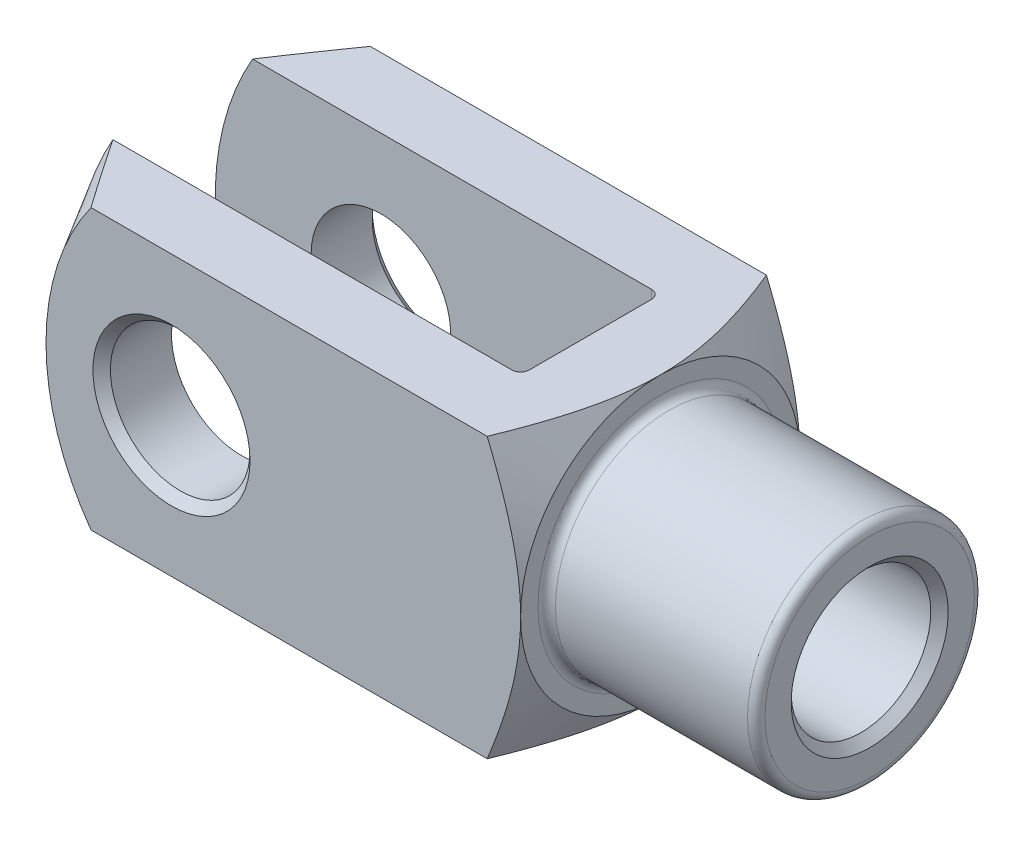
ISO-10303-21;
HEADER;
FILE_DESCRIPTION(('STEP AP214'),'2;1');
FILE_NAME('part.step','',(''),(''),'','','');
FILE_SCHEMA(('AUTOMOTIVE_DESIGN { 1 0 10303 214 1 1 1 1 }'));
ENDSEC;
DATA;
#1=APPLICATION_CONTEXT('core data for automotive mechanical design processes');
#2=APPLICATION_PROTOCOL_DEFINITION('international standard','automotive_design',2000,#1);
#3=PRODUCT_CONTEXT('',#1,'mechanical');
#4=PRODUCT('Part','Part','',(#3));
#5=PRODUCT_RELATED_PRODUCT_CATEGORY('part','',(#4));
#6=PRODUCT_DEFINITION_FORMATION('','',#4);
#7=PRODUCT_DEFINITION_CONTEXT('part definition',#1,'design');
#8=PRODUCT_DEFINITION('design','',#6,#7);
#9=PRODUCT_DEFINITION_SHAPE('','',#8);
#10=(LENGTH_UNIT() NAMED_UNIT(*) SI_UNIT(.MILLI.,.METRE.));
#11=(NAMED_UNIT(*) PLANE_ANGLE_UNIT() SI_UNIT($,.RADIAN.));
#12=(NAMED_UNIT(*) SI_UNIT($,.STERADIAN.) SOLID_ANGLE_UNIT());
#13=UNCERTAINTY_MEASURE_WITH_UNIT(LENGTH_MEASURE(1.E-05),#10,'distance_accuracy_value','');
#14=(GEOMETRIC_REPRESENTATION_CONTEXT(3) GLOBAL_UNCERTAINTY_ASSIGNED_CONTEXT((#13)) GLOBAL_UNIT_ASSIGNED_CONTEXT((#10,
#11,#12)) REPRESENTATION_CONTEXT('',''));
#15=CARTESIAN_POINT('',(0.,0.,0.));
#16=DIRECTION('',(0.,0.,1.));
#17=DIRECTION('',(1.,0.,0.));
#18=AXIS2_PLACEMENT_3D('',#15,#16,#17);
#19=CARTESIAN_POINT('',(-33.,-16.,-6.99999999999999));
#20=DIRECTION('',(0.,-1.,0.));
#21=DIRECTION('',(0.,0.,-1.));
#22=AXIS2_PLACEMENT_3D('',#19,#20,#21);
#23=CYLINDRICAL_SURFACE('',#22,1.);
#24=DIRECTION('',(0.,1.,0.));
#25=VECTOR('',#24,1.);
#26=CARTESIAN_POINT('',(-32.,-16.,-6.99999999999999));
#27=LINE('',#26,#25);
#28=CARTESIAN_POINT('',(-32.,-3.87298334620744,-6.99999999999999));
#29=VERTEX_POINT('',#28);
#30=CARTESIAN_POINT('',(-32.,-16.,-6.99999999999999));
#31=VERTEX_POINT('',#30);
#32=EDGE_CURVE('E358',#29,#31,#27,.F.);
#33=ORIENTED_EDGE('',*,*,#32,.F.);
#34=CARTESIAN_POINT('',(-32.,-3.87298334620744,-6.99999999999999));
#35=CARTESIAN_POINT('',(-32.0000090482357,-3.81506111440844,-7.0320487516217));
#36=CARTESIAN_POINT('',(-32.0015394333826,-3.75675902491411,-7.06336585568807));
#37=CARTESIAN_POINT('',(-32.0073016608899,-3.63952511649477,-7.12448038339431));
#38=CARTESIAN_POINT('',(-32.0115323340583,-3.58059358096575,-7.15427845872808));
#39=CARTESIAN_POINT('',(-32.0277410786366,-3.40324230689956,-7.2412187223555));
#40=CARTESIAN_POINT('',(-32.0432390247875,-3.28400247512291,-7.29605254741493));
#41=CARTESIAN_POINT('',(-32.0814785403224,-3.04456972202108,-7.39915667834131));
#42=CARTESIAN_POINT('',(-32.1041870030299,-2.92438355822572,-7.44745557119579));
#43=CARTESIAN_POINT('',(-32.1553570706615,-2.68282861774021,-7.53784294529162));
#44=CARTESIAN_POINT('',(-32.1838229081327,-2.56145903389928,-7.57992681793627));
#45=CARTESIAN_POINT('',(-32.2648278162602,-2.24038507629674,-7.68273685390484));
#46=CARTESIAN_POINT('',(-32.3211617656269,-2.0399619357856,-7.73829278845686));
#47=CARTESIAN_POINT('',(-32.4418505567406,-1.63779800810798,-7.83328651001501));
#48=CARTESIAN_POINT('',(-32.5062087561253,-1.43605670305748,-7.87271752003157));
#49=CARTESIAN_POINT('',(-32.7067987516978,-0.829293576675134,-7.9674219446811));
#50=CARTESIAN_POINT('',(-32.8505643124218,-0.422667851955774,-7.99912712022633));
#51=CARTESIAN_POINT('',(-32.9960248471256,-0.011243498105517,-7.99999406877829));
#52=CARTESIAN_POINT('',(-32.998012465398,-0.00562166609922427,-7.99999999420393));
#53=CARTESIAN_POINT('',(-33.,0.,-7.99999999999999));
#54=B_SPLINE_CURVE_WITH_KNOTS('',3,(#34,#35,#36,#37,#38,#39,#40,#41,#42,#43,#44,#45,#46,#47,#48,
#49,#50,#51,#52,#53),.UNSPECIFIED.,.F.,.F.,(4,2,2,2,2,2,2,2,2,4),(0.,0.198535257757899,
0.396984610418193,0.792983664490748,1.18719018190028,1.58168756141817,2.22713013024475,
2.8728436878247,4.16406208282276,4.18195063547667),.UNSPECIFIED.);
#55=CARTESIAN_POINT('',(-33.,0.,-7.99999999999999));
#56=VERTEX_POINT('',#55);
#57=EDGE_CURVE('E389',#29,#56,#54,.T.);
#58=ORIENTED_EDGE('',*,*,#57,.T.);
#59=DIRECTION('',(0.,1.,0.));
#60=VECTOR('',#59,1.);
#61=CARTESIAN_POINT('',(-33.,16.,-7.99999999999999));
#62=LINE('',#61,#60);
#63=CARTESIAN_POINT('',(-33.,-16.,-7.99999999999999));
#64=VERTEX_POINT('',#63);
#65=EDGE_CURVE('E182',#64,#56,#62,.T.);
#66=ORIENTED_EDGE('',*,*,#65,.F.);
#67=CARTESIAN_POINT('',(-33.,-16.,-6.99999999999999));
#68=DIRECTION('',(0.,-1.,0.));
#69=DIRECTION('',(0.,0.,-1.));
#70=AXIS2_PLACEMENT_3D('',#67,#68,#69);
#71=CIRCLE('',#70,1.);
#72=EDGE_CURVE('E197',#31,#64,#71,.F.);
#73=ORIENTED_EDGE('',*,*,#72,.F.);
#74=EDGE_LOOP('',(#33,#58,#66,#73));
#75=FACE_BOUND('',#74,.T.);
#76=ADVANCED_FACE('F37',(#75),#23,.F.);
#77=CARTESIAN_POINT('',(-32.,-16.,-7.99999999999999));
#78=DIRECTION('',(1.,0.,0.));
#79=DIRECTION('',(0.,0.,-1.));
#80=AXIS2_PLACEMENT_3D('',#77,#78,#79);
#81=PLANE('',#80);
#82=CARTESIAN_POINT('',(-32.,16.,-6.99999999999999));
#83=VERTEX_POINT('',#82);
#84=CARTESIAN_POINT('',(-32.,3.87298334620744,-6.99999999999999));
#85=VERTEX_POINT('',#84);
#86=EDGE_CURVE('E374',#83,#85,#27,.F.);
#87=ORIENTED_EDGE('',*,*,#86,.T.);
#88=CARTESIAN_POINT('',(-32.,0.,0.));
#89=DIRECTION('',(1.,0.,0.));
#90=DIRECTION('',(0.,0.,-1.));
#91=AXIS2_PLACEMENT_3D('',#88,#89,#90);
#92=CIRCLE('',#91,8.);
#93=CARTESIAN_POINT('',(-32.,3.87298334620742,7.));
#94=VERTEX_POINT('',#93);
#95=EDGE_CURVE('E450',#85,#94,#92,.T.);
#96=ORIENTED_EDGE('',*,*,#95,.T.);
#97=DIRECTION('',(0.,1.,0.));
#98=VECTOR('',#97,1.);
#99=CARTESIAN_POINT('',(-32.,16.,7.));
#100=LINE('',#99,#98);
#101=CARTESIAN_POINT('',(-32.,16.,7.));
#102=VERTEX_POINT('',#101);
#103=EDGE_CURVE('E160',#94,#102,#100,.T.);
#104=ORIENTED_EDGE('',*,*,#103,.T.);
#105=DIRECTION('',(0.,0.,-1.));
#106=VECTOR('',#105,1.);
#107=CARTESIAN_POINT('',(-32.,16.,-7.99999999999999));
#108=LINE('',#107,#106);
#109=EDGE_CURVE('E338',#102,#83,#108,.T.);
#110=ORIENTED_EDGE('',*,*,#109,.T.);
#111=EDGE_LOOP('',(#87,#96,#104,#110));
#112=FACE_BOUND('',#111,.T.);
#113=ADVANCED_FACE('F497',(#112),#81,.F.);
#114=CARTESIAN_POINT('',(-33.,-16.,7.));
#115=DIRECTION('',(0.,-1.,0.));
#116=DIRECTION('',(0.,0.,-1.));
#117=AXIS2_PLACEMENT_3D('',#114,#115,#116);
#118=CYLINDRICAL_SURFACE('',#117,1.);
#119=ORIENTED_EDGE('',*,*,#103,.F.);
#120=CARTESIAN_POINT('',(-32.,3.87298334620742,7.));
#121=CARTESIAN_POINT('',(-32.0000090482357,3.81506111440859,7.03204875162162));
#122=CARTESIAN_POINT('',(-32.0015394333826,3.75675902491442,7.0633658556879));
#123=CARTESIAN_POINT('',(-32.0073016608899,3.63952511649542,7.12448038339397));
#124=CARTESIAN_POINT('',(-32.0115323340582,3.58059358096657,7.15427845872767));
#125=CARTESIAN_POINT('',(-32.0277410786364,3.40324230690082,7.2412187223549));
#126=CARTESIAN_POINT('',(-32.0432390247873,3.28400247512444,7.29605254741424));
#127=CARTESIAN_POINT('',(-32.0814785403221,3.04456972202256,7.39915667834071));
#128=CARTESIAN_POINT('',(-32.1041870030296,2.92438355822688,7.44745557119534));
#129=CARTESIAN_POINT('',(-32.1553570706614,2.68282861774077,7.53784294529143));
#130=CARTESIAN_POINT('',(-32.1838229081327,2.56145903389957,7.57992681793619));
#131=CARTESIAN_POINT('',(-32.26482781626,2.24038507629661,7.68273685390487));
#132=CARTESIAN_POINT('',(-32.3211617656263,2.03996193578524,7.73829278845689));
#133=CARTESIAN_POINT('',(-32.4418505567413,1.63779800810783,7.83328651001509));
#134=CARTESIAN_POINT('',(-32.5062087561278,1.43605670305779,7.87271752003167));
#135=CARTESIAN_POINT('',(-32.7067987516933,0.82929357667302,7.96742194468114));
#136=CARTESIAN_POINT('',(-32.8505643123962,0.422667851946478,7.99912712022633));
#137=CARTESIAN_POINT('',(-32.9960248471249,0.0112434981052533,7.99999406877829));
#138=CARTESIAN_POINT('',(-32.9980124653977,0.00562166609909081,7.99999999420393));
#139=CARTESIAN_POINT('',(-33.,0.,8.));
#140=B_SPLINE_CURVE_WITH_KNOTS('',3,(#120,#121,#122,#123,#124,#125,#126,#127,#128,#129,#130,
#131,#132,#133,#134,#135,#136,#137,#138,#139),.UNSPECIFIED.,.F.,.F.,(4,2,2,2,2,2,2,2,2,4),(0.,
0.198535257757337,0.396984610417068,0.792983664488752,1.18719018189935,1.58168756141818,
2.22713013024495,2.8728436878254,4.16406208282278,4.18195063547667),.UNSPECIFIED.);
#141=CARTESIAN_POINT('',(-33.,0.,8.));
#142=VERTEX_POINT('',#141);
#143=EDGE_CURVE('E145',#94,#142,#140,.T.);
#144=ORIENTED_EDGE('',*,*,#143,.T.);
#145=DIRECTION('',(0.,1.,0.));
#146=VECTOR('',#145,1.);
#147=CARTESIAN_POINT('',(-33.,-16.,7.99999999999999));
#148=LINE('',#147,#146);
#149=CARTESIAN_POINT('',(-33.,16.,7.99999999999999));
#150=VERTEX_POINT('',#149);
#151=EDGE_CURVE('E159',#150,#142,#148,.F.);
#152=ORIENTED_EDGE('',*,*,#151,.F.);
#153=CARTESIAN_POINT('',(-33.,16.,7.));
#154=DIRECTION('',(0.,1.,0.));
#155=DIRECTION('',(0.,0.,1.));
#156=AXIS2_PLACEMENT_3D('',#153,#154,#155);
#157=CIRCLE('',#156,1.);
#158=EDGE_CURVE('E189',#102,#150,#157,.F.);
#159=ORIENTED_EDGE('',*,*,#158,.F.);
#160=EDGE_LOOP('',(#119,#144,#152,#159));
#161=FACE_BOUND('',#160,.T.);
#162=ADVANCED_FACE('F156',(#161),#118,.F.);
#163=CARTESIAN_POINT('',(-83.,-16.,-7.99999999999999));
#164=DIRECTION('',(0.,0.,-1.));
#165=DIRECTION('',(-1.,0.,0.));
#166=AXIS2_PLACEMENT_3D('',#163,#164,#165);
#167=PLANE('',#166);
#168=CARTESIAN_POINT('',(-64.,0.,-7.99999999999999));
#169=DIRECTION('',(0.,0.,-1.));
#170=DIRECTION('',(-1.,0.,0.));
#171=AXIS2_PLACEMENT_3D('',#168,#169,#170);
#172=CIRCLE('',#171,8.);
#173=CARTESIAN_POINT('',(-72.,0.,-7.99999999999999));
#174=VERTEX_POINT('',#173);
#175=EDGE_CURVE('E368',#174,#174,#172,.F.);
#176=ORIENTED_EDGE('',*,*,#175,.F.);
#177=EDGE_LOOP('',(#176));
#178=FACE_BOUND('',#177,.T.);
#179=CARTESIAN_POINT('',(-51.,0.,-7.99999999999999));
#180=DIRECTION('',(0.,0.,1.));
#181=DIRECTION('',(1.,0.,0.));
#182=AXIS2_PLACEMENT_3D('',#179,#180,#181);
#183=CIRCLE('',#182,32.);
#184=CARTESIAN_POINT('',(-78.712812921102,16.,-7.99999999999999));
#185=VERTEX_POINT('',#184);
#186=CARTESIAN_POINT('',(-78.712812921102,-16.,-7.99999999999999));
#187=VERTEX_POINT('',#186);
#188=EDGE_CURVE('E276',#185,#187,#183,.T.);
#189=ORIENTED_EDGE('',*,*,#188,.T.);
#190=DIRECTION('',(-1.,0.,0.));
#191=VECTOR('',#190,1.);
#192=CARTESIAN_POINT('',(-83.,-16.,-7.99999999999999));
#193=LINE('',#192,#191);
#194=EDGE_CURVE('E333',#64,#187,#193,.T.);
#195=ORIENTED_EDGE('',*,*,#194,.F.);
#196=ORIENTED_EDGE('',*,*,#65,.T.);
#197=CARTESIAN_POINT('',(-33.,16.,-7.99999999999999));
#198=VERTEX_POINT('',#197);
#199=EDGE_CURVE('E179',#56,#198,#62,.T.);
#200=ORIENTED_EDGE('',*,*,#199,.T.);
#201=DIRECTION('',(-1.,0.,0.));
#202=VECTOR('',#201,1.);
#203=CARTESIAN_POINT('',(-83.,16.,-7.99999999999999));
#204=LINE('',#203,#202);
#205=EDGE_CURVE('E346',#198,#185,#204,.T.);
#206=ORIENTED_EDGE('',*,*,#205,.T.);
#207=EDGE_LOOP('',(#189,#195,#196,#200,#206));
#208=FACE_BOUND('',#207,.T.);
#209=ADVANCED_FACE('F392',(#178,#208),#167,.F.);
#210=CARTESIAN_POINT('',(-83.,-16.,8.00000000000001));
#211=DIRECTION('',(0.,0.,1.));
#212=DIRECTION('',(1.,0.,0.));
#213=AXIS2_PLACEMENT_3D('',#210,#211,#212);
#214=PLANE('',#213);
#215=CARTESIAN_POINT('',(-64.,0.,8.));
#216=DIRECTION('',(0.,0.,1.));
#217=DIRECTION('',(1.,0.,0.));
#218=AXIS2_PLACEMENT_3D('',#215,#216,#217);
#219=CIRCLE('',#218,8.);
#220=CARTESIAN_POINT('',(-56.,0.,8.));
#221=VERTEX_POINT('',#220);
#222=EDGE_CURVE('E345',#221,#221,#219,.F.);
#223=ORIENTED_EDGE('',*,*,#222,.F.);
#224=EDGE_LOOP('',(#223));
#225=FACE_BOUND('',#224,.T.);
#226=DIRECTION('',(1.,0.,0.));
#227=VECTOR('',#226,1.);
#228=CARTESIAN_POINT('',(-83.,-16.,8.00000000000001));
#229=LINE('',#228,#227);
#230=CARTESIAN_POINT('',(-78.712812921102,-16.,8.00000000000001));
#231=VERTEX_POINT('',#230);
#232=CARTESIAN_POINT('',(-33.,-16.,7.99999999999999));
#233=VERTEX_POINT('',#232);
#234=EDGE_CURVE('E337',#231,#233,#229,.T.);
#235=ORIENTED_EDGE('',*,*,#234,.F.);
#236=CARTESIAN_POINT('',(-51.,0.,8.00000000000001));
#237=DIRECTION('',(0.,0.,1.));
#238=DIRECTION('',(1.,0.,0.));
#239=AXIS2_PLACEMENT_3D('',#236,#237,#238);
#240=CIRCLE('',#239,32.);
#241=CARTESIAN_POINT('',(-78.712812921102,16.,8.00000000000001));
#242=VERTEX_POINT('',#241);
#243=EDGE_CURVE('E416',#242,#231,#240,.T.);
#244=ORIENTED_EDGE('',*,*,#243,.F.);
#245=DIRECTION('',(1.,0.,0.));
#246=VECTOR('',#245,1.);
#247=CARTESIAN_POINT('',(-83.,16.,8.00000000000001));
#248=LINE('',#247,#246);
#249=EDGE_CURVE('E176',#242,#150,#248,.T.);
#250=ORIENTED_EDGE('',*,*,#249,.T.);
#251=ORIENTED_EDGE('',*,*,#151,.T.);
#252=EDGE_CURVE('E164',#142,#233,#148,.F.);
#253=ORIENTED_EDGE('',*,*,#252,.T.);
#254=EDGE_LOOP('',(#235,#244,#250,#251,#253));
#255=FACE_BOUND('',#254,.T.);
#256=ADVANCED_FACE('F173',(#225,#255),#214,.F.);
#257=CARTESIAN_POINT('',(-83.,-16.,16.));
#258=DIRECTION('',(0.,0.,1.));
#259=DIRECTION('',(1.,0.,0.));
#260=AXIS2_PLACEMENT_3D('',#257,#258,#259);
#261=PLANE('',#260);
#262=CARTESIAN_POINT('',(-64.,0.,16.));
#263=DIRECTION('',(0.,0.,1.));
#264=DIRECTION('',(1.,0.,0.));
#265=AXIS2_PLACEMENT_3D('',#262,#263,#264);
#266=CIRCLE('',#265,8.99999999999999);
#267=CARTESIAN_POINT('',(-55.,0.,16.));
#268=VERTEX_POINT('',#267);
#269=EDGE_CURVE('E228',#268,#268,#266,.F.);
#270=ORIENTED_EDGE('',*,*,#269,.T.);
#271=EDGE_LOOP('',(#270));
#272=FACE_BOUND('',#271,.T.);
#273=DIRECTION('',(1.,0.,0.));
#274=VECTOR('',#273,1.);
#275=CARTESIAN_POINT('',(-83.,16.,16.));
#276=LINE('',#275,#274);
#277=CARTESIAN_POINT('',(-73.2200359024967,16.,16.));
#278=VERTEX_POINT('',#277);
#279=CARTESIAN_POINT('',(-27.8263409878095,16.,16.));
#280=VERTEX_POINT('',#279);
#281=EDGE_CURVE('E365',#278,#280,#276,.T.);
#282=ORIENTED_EDGE('',*,*,#281,.F.);
#283=CARTESIAN_POINT('',(-51.,0.,16.));
#284=DIRECTION('',(0.,0.,1.));
#285=DIRECTION('',(1.,0.,0.));
#286=AXIS2_PLACEMENT_3D('',#283,#284,#285);
#287=CIRCLE('',#286,27.381197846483);
#288=CARTESIAN_POINT('',(-73.2200359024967,-16.,16.));
#289=VERTEX_POINT('',#288);
#290=EDGE_CURVE('E61',#278,#289,#287,.T.);
#291=ORIENTED_EDGE('',*,*,#290,.T.);
#292=DIRECTION('',(1.,0.,0.));
#293=VECTOR('',#292,1.);
#294=CARTESIAN_POINT('',(-83.,-16.,16.));
#295=LINE('',#294,#293);
#296=CARTESIAN_POINT('',(-27.8263409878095,-16.,16.));
#297=VERTEX_POINT('',#296);
#298=EDGE_CURVE('E362',#289,#297,#295,.T.);
#299=ORIENTED_EDGE('',*,*,#298,.T.);
#300=CARTESIAN_POINT('',(-35.7693975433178,-32.6784696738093,16.));
#301=CARTESIAN_POINT('',(-35.5649534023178,-32.2841914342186,16.));
#302=CARTESIAN_POINT('',(-35.3610695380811,-31.8896227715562,16.));
#303=CARTESIAN_POINT('',(-34.9545422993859,-31.0998453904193,16.));
#304=CARTESIAN_POINT('',(-34.7518989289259,-30.7046366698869,16.));
#305=CARTESIAN_POINT('',(-34.1459910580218,-29.5179255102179,16.));
#306=CARTESIAN_POINT('',(-33.7447694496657,-28.725377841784,16.));
#307=CARTESIAN_POINT('',(-32.948304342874,-27.1355535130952,16.));
#308=CARTESIAN_POINT('',(-32.5530724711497,-26.3382710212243,16.));
#309=CARTESIAN_POINT('',(-31.7709229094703,-24.7396478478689,16.));
#310=CARTESIAN_POINT('',(-31.3840050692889,-23.9383072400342,16.));
#311=CARTESIAN_POINT('',(-30.5971278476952,-22.2812030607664,16.));
#312=CARTESIAN_POINT('',(-30.1978306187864,-21.4251243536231,16.));
#313=CARTESIAN_POINT('',(-29.4144189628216,-19.7059517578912,16.));
#314=CARTESIAN_POINT('',(-29.0303053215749,-18.8428575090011,16.));
#315=CARTESIAN_POINT('',(-28.469277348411,-17.5419055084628,16.));
#316=CARTESIAN_POINT('',(-28.2848287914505,-17.1072946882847,16.));
#317=CARTESIAN_POINT('',(-27.9217435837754,-16.2356552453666,16.));
#318=CARTESIAN_POINT('',(-27.7431068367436,-15.7986266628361,16.));
#319=CARTESIAN_POINT('',(-27.3925648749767,-14.9219132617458,16.));
#320=CARTESIAN_POINT('',(-27.2206591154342,-14.4822286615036,16.));
#321=CARTESIAN_POINT('',(-26.8846508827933,-13.5998952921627,16.));
#322=CARTESIAN_POINT('',(-26.7205482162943,-13.15724659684,16.));
#323=CARTESIAN_POINT('',(-26.3667959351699,-12.1723292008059,16.));
#324=CARTESIAN_POINT('',(-26.1793236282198,-11.6292738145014,16.));
#325=CARTESIAN_POINT('',(-25.8205117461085,-10.5378822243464,16.));
#326=CARTESIAN_POINT('',(-25.6491707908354,-9.98954647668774,16.));
#327=CARTESIAN_POINT('',(-25.3258019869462,-8.88718113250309,16.));
#328=CARTESIAN_POINT('',(-25.1737737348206,-8.33315165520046,16.));
#329=CARTESIAN_POINT('',(-24.892661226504,-7.21925530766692,16.));
#330=CARTESIAN_POINT('',(-24.763576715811,-6.65938850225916,16.));
#331=CARTESIAN_POINT('',(-24.5349588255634,-5.54729135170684,16.));
#332=CARTESIAN_POINT('',(-24.4348028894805,-4.99519025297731,16.));
#333=CARTESIAN_POINT('',(-24.2636126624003,-3.88645323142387,16.));
#334=CARTESIAN_POINT('',(-24.1925774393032,-3.32981745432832,16.));
#335=CARTESIAN_POINT('',(-24.0825979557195,-2.21371046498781,16.));
#336=CARTESIAN_POINT('',(-24.0436327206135,-1.65424134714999,16.));
#337=CARTESIAN_POINT('',(-23.9995121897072,-0.533966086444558,16.));
#338=CARTESIAN_POINT('',(-23.9943557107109,0.026840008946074,16.));
#339=CARTESIAN_POINT('',(-24.0172205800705,1.106864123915,16.));
#340=CARTESIAN_POINT('',(-24.0428517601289,1.62613491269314,16.));
#341=CARTESIAN_POINT('',(-24.1223285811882,2.66248971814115,16.));
#342=CARTESIAN_POINT('',(-24.1761741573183,3.1795737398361,16.));
#343=CARTESIAN_POINT('',(-24.3101058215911,4.21056490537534,16.));
#344=CARTESIAN_POINT('',(-24.3902054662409,4.7244702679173,16.));
#345=CARTESIAN_POINT('',(-24.5740043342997,5.74801582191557,16.));
#346=CARTESIAN_POINT('',(-24.6777042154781,6.25765589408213,16.));
#347=CARTESIAN_POINT('',(-24.909120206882,7.28692593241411,16.));
#348=CARTESIAN_POINT('',(-25.0374445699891,7.80641809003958,16.));
#349=CARTESIAN_POINT('',(-25.3129308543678,8.84034891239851,16.));
#350=CARTESIAN_POINT('',(-25.4600929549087,9.35478752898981,16.));
#351=CARTESIAN_POINT('',(-25.7704071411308,10.3787720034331,16.));
#352=CARTESIAN_POINT('',(-25.9335585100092,10.8883180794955,16.));
#353=CARTESIAN_POINT('',(-26.1884088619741,11.6492037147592,16.));
#354=CARTESIAN_POINT('',(-26.2750447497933,11.9022560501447,16.));
#355=CARTESIAN_POINT('',(-26.4514227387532,12.4072754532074,16.));
#356=CARTESIAN_POINT('',(-26.5411648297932,12.6592425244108,16.));
#357=CARTESIAN_POINT('',(-26.8295171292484,13.454575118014,16.));
#358=CARTESIAN_POINT('',(-27.0333628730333,13.9960468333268,16.));
#359=CARTESIAN_POINT('',(-27.4521222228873,15.0747063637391,16.));
#360=CARTESIAN_POINT('',(-27.6670364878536,15.6118939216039,16.));
#361=CARTESIAN_POINT('',(-28.1061456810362,16.6825956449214,16.));
#362=CARTESIAN_POINT('',(-28.3303426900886,17.216108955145,16.));
#363=CARTESIAN_POINT('',(-28.786473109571,18.2797983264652,16.));
#364=CARTESIAN_POINT('',(-29.0184063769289,18.8099744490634,16.));
#365=CARTESIAN_POINT('',(-29.4890009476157,19.8678755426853,16.));
#366=CARTESIAN_POINT('',(-29.727667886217,20.3955980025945,16.));
#367=CARTESIAN_POINT('',(-30.2105443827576,21.448499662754,16.));
#368=CARTESIAN_POINT('',(-30.4547539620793,21.9736788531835,16.));
#369=CARTESIAN_POINT('',(-30.9478700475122,23.0217502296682,16.));
#370=CARTESIAN_POINT('',(-31.1967760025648,23.5446426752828,16.));
#371=CARTESIAN_POINT('',(-31.6986473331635,24.5884772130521,16.));
#372=CARTESIAN_POINT('',(-31.951612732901,25.1094192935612,16.));
#373=CARTESIAN_POINT('',(-32.7172875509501,26.6728451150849,16.));
#374=CARTESIAN_POINT('',(-33.2352702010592,27.7127471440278,16.));
#375=CARTESIAN_POINT('',(-34.2818275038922,29.7872182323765,16.));
#376=CARTESIAN_POINT('',(-34.8104023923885,30.8217871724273,16.));
#377=CARTESIAN_POINT('',(-35.8754784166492,32.8861860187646,16.));
#378=CARTESIAN_POINT('',(-36.4119755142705,33.916018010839,16.));
#379=CARTESIAN_POINT('',(-37.491399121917,35.9722925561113,16.));
#380=CARTESIAN_POINT('',(-38.0343255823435,36.9987351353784,16.));
#381=CARTESIAN_POINT('',(-39.0443143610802,38.8966473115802,16.));
#382=CARTESIAN_POINT('',(-39.5106690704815,39.7684938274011,16.));
#383=CARTESIAN_POINT('',(-40.446506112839,41.5105071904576,16.));
#384=CARTESIAN_POINT('',(-40.9159884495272,42.3806740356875,16.));
#385=CARTESIAN_POINT('',(-42.3285002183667,44.9892873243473,16.));
#386=CARTESIAN_POINT('',(-43.2754644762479,46.7256030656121,16.));
#387=CARTESIAN_POINT('',(-45.1715733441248,50.1841146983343,16.));
#388=CARTESIAN_POINT('',(-46.120674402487,51.9063345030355,16.));
#389=CARTESIAN_POINT('',(-47.5485244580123,54.4871624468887,16.));
#390=CARTESIAN_POINT('',(-48.0251365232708,55.3469538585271,16.));
#391=CARTESIAN_POINT('',(-48.979616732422,57.0658379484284,16.));
#392=CARTESIAN_POINT('',(-49.4574848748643,57.9249306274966,16.));
#393=CARTESIAN_POINT('',(-49.9358976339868,58.7837198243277,16.));
#394=B_SPLINE_CURVE_WITH_KNOTS('',3,(#300,#301,#302,#303,#304,#305,#306,#307,#308,#309,#310,
#311,#312,#313,#314,#315,#316,#317,#318,#319,#320,#321,#322,#323,#324,#325,#326,#327,#328,#329,
#330,#331,#332,#333,#334,#335,#336,#337,#338,#339,#340,#341,#342,#343,#344,#345,#346,#347,#348,
#349,#350,#351,#352,#353,#354,#355,#356,#357,#358,#359,#360,#361,#362,#363,#364,#365,#366,#367,
#368,#369,#370,#371,#372,#373,#374,#375,#376,#377,#378,#379,#380,#381,#382,#383,#384,#385,#386,
#387,#388,#389,#390,#391,#392,#393),.UNSPECIFIED.,.F.,.F.,(4,2,2,2,2,2,2,2,2,2,2,2,2,2,2,2,2,2,
2,2,2,2,2,2,2,2,2,2,2,2,2,2,2,2,2,2,2,2,2,2,2,2,2,2,2,2,4),(0.,1.33239347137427,
2.66479123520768,5.32972119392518,7.99929176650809,10.6688140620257,13.5025727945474,
16.3364779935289,17.7528378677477,19.1691742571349,20.5853957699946,22.0015821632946,
23.7248813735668,25.4480330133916,27.1711486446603,28.8942451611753,30.5768935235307,
32.2594880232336,33.9409811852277,35.6224155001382,37.1813298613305,38.7402406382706,
40.2999576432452,41.8597181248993,43.4646245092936,45.0695461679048,46.6743959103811,
47.4767954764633,48.2791924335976,50.0147426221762,51.7503962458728,53.4864410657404,
55.2224537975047,56.95996517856,58.6974832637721,60.4347987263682,62.1721245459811,
65.6573336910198,69.1426204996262,72.626188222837,76.1097290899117,79.0759362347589,
82.0421469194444,87.9753961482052,93.8746630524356,96.8238320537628,99.772997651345),.UNSPECIFIED.);
#395=CARTESIAN_POINT('',(-24.,0.,16.));
#396=VERTEX_POINT('',#395);
#397=EDGE_CURVE('E305',#396,#297,#394,.F.);
#398=ORIENTED_EDGE('',*,*,#397,.F.);
#399=EDGE_CURVE('E303',#280,#396,#394,.F.);
#400=ORIENTED_EDGE('',*,*,#399,.F.);
#401=EDGE_LOOP('',(#282,#291,#299,#398,#400));
#402=FACE_BOUND('',#401,.T.);
#403=ADVANCED_FACE('F287',(#272,#402),#261,.T.);
#404=CARTESIAN_POINT('',(-83.,-16.,16.));
#405=DIRECTION('',(0.,-1.,0.));
#406=DIRECTION('',(0.,0.,-1.));
#407=AXIS2_PLACEMENT_3D('',#404,#405,#406);
#408=PLANE('',#407);
#409=ORIENTED_EDGE('',*,*,#194,.T.);
#410=CARTESIAN_POINT('',(-91.3714292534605,-16.,11.7911070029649));
#411=CARTESIAN_POINT('',(-90.5929450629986,-16.,10.5376757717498));
#412=CARTESIAN_POINT('',(-89.8123280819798,-16.,9.28556385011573));
#413=CARTESIAN_POINT('',(-88.2458326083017,-16.,6.78460141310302));
#414=CARTESIAN_POINT('',(-87.4599540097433,-16.,5.53575096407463));
#415=CARTESIAN_POINT('',(-85.881028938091,-16.,3.04049656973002));
#416=CARTESIAN_POINT('',(-85.0879750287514,-16.,1.79409732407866));
#417=CARTESIAN_POINT('',(-83.8927062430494,-16.,-0.0718476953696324));
#418=CARTESIAN_POINT('',(-83.4933374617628,-16.,-0.693217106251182));
#419=CARTESIAN_POINT('',(-82.6924903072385,-16.,-1.9346009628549));
#420=CARTESIAN_POINT('',(-82.2910119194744,-16.,-2.55461539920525));
#421=CARTESIAN_POINT('',(-81.0495570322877,-16.,-4.46394316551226));
#422=CARTESIAN_POINT('',(-80.2056856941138,-16.,-5.75072871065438));
#423=CARTESIAN_POINT('',(-78.5052163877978,-16.,-8.31586424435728));
#424=CARTESIAN_POINT('',(-77.6486185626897,-16.,-9.59421432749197));
#425=CARTESIAN_POINT('',(-76.351696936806,-16.,-11.5028868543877));
#426=CARTESIAN_POINT('',(-75.9175465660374,-16.,-12.1374051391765));
#427=CARTESIAN_POINT('',(-75.0445181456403,-16.,-13.4031790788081));
#428=CARTESIAN_POINT('',(-74.6056401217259,-16.,-14.0344347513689));
#429=CARTESIAN_POINT('',(-73.7224503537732,-16.,-15.2930972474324));
#430=CARTESIAN_POINT('',(-73.2781388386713,-16.,-15.9205042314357));
#431=CARTESIAN_POINT('',(-72.3831787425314,-16.,-17.170777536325));
#432=CARTESIAN_POINT('',(-71.9325302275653,-16.,-17.7936439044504));
#433=CARTESIAN_POINT('',(-71.0280293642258,-16.,-19.0281553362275));
#434=CARTESIAN_POINT('',(-70.5742460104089,-16.,-19.63985087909));
#435=CARTESIAN_POINT('',(-69.6580392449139,-16.,-20.8567662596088));
#436=CARTESIAN_POINT('',(-69.1956156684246,-16.,-21.4619859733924));
#437=CARTESIAN_POINT('',(-68.2598142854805,-16.,-22.6652514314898));
#438=CARTESIAN_POINT('',(-67.7864223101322,-16.,-23.2632861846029));
#439=CARTESIAN_POINT('',(-66.8271654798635,-16.,-24.449237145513));
#440=CARTESIAN_POINT('',(-66.3413013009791,-16.,-25.0371538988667));
#441=CARTESIAN_POINT('',(-65.359384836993,-16.,-26.1940459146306));
#442=CARTESIAN_POINT('',(-64.8634904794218,-16.,-26.7631543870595));
#443=CARTESIAN_POINT('',(-64.1056619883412,-16.,-27.604363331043));
#444=CARTESIAN_POINT('',(-63.8506801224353,-16.,-27.8827334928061));
#445=CARTESIAN_POINT('',(-63.3355101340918,-16.,-28.4346076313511));
#446=CARTESIAN_POINT('',(-63.0753221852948,-16.,-28.7081117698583));
#447=CARTESIAN_POINT('',(-62.5496746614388,-16.,-29.2488627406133));
#448=CARTESIAN_POINT('',(-62.2842277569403,-16.,-29.5161218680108));
#449=CARTESIAN_POINT('',(-61.7468052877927,-16.,-30.0439769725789));
#450=CARTESIAN_POINT('',(-61.474830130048,-16.,-30.3045733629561));
#451=CARTESIAN_POINT('',(-60.9236476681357,-16.,-30.8177372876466));
#452=CARTESIAN_POINT('',(-60.6444440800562,-16.,-31.0703088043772));
#453=CARTESIAN_POINT('',(-60.0777664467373,-16.,-31.5659640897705));
#454=CARTESIAN_POINT('',(-59.7902936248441,-16.,-31.8090492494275));
#455=CARTESIAN_POINT('',(-59.3468920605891,-16.,-32.1692925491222));
#456=CARTESIAN_POINT('',(-59.19437175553,-16.,-32.2906537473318));
#457=CARTESIAN_POINT('',(-58.8866765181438,-16.,-32.5299575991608));
#458=CARTESIAN_POINT('',(-58.7315016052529,-16.,-32.6479002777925));
#459=CARTESIAN_POINT('',(-58.261690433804,-16.,-32.9961048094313));
#460=CARTESIAN_POINT('',(-57.9428096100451,-16.,-33.2207088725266));
#461=CARTESIAN_POINT('',(-57.2928256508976,-16.,-33.6509952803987));
#462=CARTESIAN_POINT('',(-56.9617323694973,-16.,-33.8566924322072));
#463=CARTESIAN_POINT('',(-56.286089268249,-16.,-34.2447467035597));
#464=CARTESIAN_POINT('',(-55.9415429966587,-16.,-34.4271099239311));
#465=CARTESIAN_POINT('',(-55.3187542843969,-16.,-34.7245627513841));
#466=CARTESIAN_POINT('',(-55.0433165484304,-16.,-34.845508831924));
#467=CARTESIAN_POINT('',(-54.4844448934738,-16.,-35.0671656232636));
#468=CARTESIAN_POINT('',(-54.2010136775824,-16.,-35.167883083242));
#469=CARTESIAN_POINT('',(-53.6272287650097,-16.,-35.3459456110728));
#470=CARTESIAN_POINT('',(-53.3368843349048,-16.,-35.4233202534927));
#471=CARTESIAN_POINT('',(-52.7504269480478,-16.,-35.5520122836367));
#472=CARTESIAN_POINT('',(-52.4543142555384,-16.,-35.6033308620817));
#473=CARTESIAN_POINT('',(-51.8555360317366,-16.,-35.6780890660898));
#474=CARTESIAN_POINT('',(-51.5528345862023,-16.,-35.7012449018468));
#475=CARTESIAN_POINT('',(-50.9466256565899,-16.,-35.7176301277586));
#476=CARTESIAN_POINT('',(-50.643118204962,-16.,-35.7108607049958));
#477=CARTESIAN_POINT('',(-50.03817775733,-16.,-35.6677225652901));
#478=CARTESIAN_POINT('',(-49.7367451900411,-16.,-35.6313479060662));
#479=CARTESIAN_POINT('',(-49.1385996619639,-16.,-35.5306731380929));
#480=CARTESIAN_POINT('',(-48.8418874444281,-16.,-35.4663686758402));
#481=CARTESIAN_POINT('',(-48.2008177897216,-16.,-35.2982030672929));
#482=CARTESIAN_POINT('',(-47.857810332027,-16.,-35.1892223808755));
#483=CARTESIAN_POINT('',(-47.1829198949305,-16.,-34.940831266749));
#484=CARTESIAN_POINT('',(-46.8510432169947,-16.,-34.8014039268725));
#485=CARTESIAN_POINT('',(-46.3616955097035,-16.,-34.5731174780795));
#486=CARTESIAN_POINT('',(-46.1997313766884,-16.,-34.4936845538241));
#487=CARTESIAN_POINT('',(-45.8788299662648,-16.,-34.3290841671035));
#488=CARTESIAN_POINT('',(-45.7198913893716,-16.,-34.2439192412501));
#489=CARTESIAN_POINT('',(-45.2474402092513,-16.,-33.980610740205));
#490=CARTESIAN_POINT('',(-44.9382745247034,-16.,-33.7946450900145));
#491=CARTESIAN_POINT('',(-44.2312746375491,-16.,-33.3419896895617));
#492=CARTESIAN_POINT('',(-43.8376126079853,-16.,-33.0688272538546));
#493=CARTESIAN_POINT('',(-43.0671777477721,-16.,-32.4995062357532));
#494=CARTESIAN_POINT('',(-42.6904130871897,-16.,-32.2033367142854));
#495=CARTESIAN_POINT('',(-41.9509392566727,-16.,-31.5926380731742));
#496=CARTESIAN_POINT('',(-41.588258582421,-16.,-31.2780746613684));
#497=CARTESIAN_POINT('',(-40.8756929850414,-16.,-30.6349635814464));
#498=CARTESIAN_POINT('',(-40.5258059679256,-16.,-30.3064182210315));
#499=CARTESIAN_POINT('',(-39.8346538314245,-16.,-29.6358722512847));
#500=CARTESIAN_POINT('',(-39.4934620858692,-16.,-29.2937963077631));
#501=CARTESIAN_POINT('',(-38.8205894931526,-16.,-28.6004219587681));
#502=CARTESIAN_POINT('',(-38.4889089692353,-16.,-28.2491232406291));
#503=CARTESIAN_POINT('',(-37.8341115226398,-16.,-27.5393264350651));
#504=CARTESIAN_POINT('',(-37.5109860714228,-16.,-27.1808361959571));
#505=CARTESIAN_POINT('',(-36.8718712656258,-16.,-26.4575770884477));
#506=CARTESIAN_POINT('',(-36.55588177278,-16.,-26.0928083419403));
#507=CARTESIAN_POINT('',(-35.8004695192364,-16.,-25.2057450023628));
#508=CARTESIAN_POINT('',(-35.3641536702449,-16.,-24.6808057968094));
#509=CARTESIAN_POINT('',(-34.5017899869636,-16.,-23.6224177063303));
#510=CARTESIAN_POINT('',(-34.0757441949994,-16.,-23.0889671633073));
#511=CARTESIAN_POINT('',(-33.2388292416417,-16.,-22.0234541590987));
#512=CARTESIAN_POINT('',(-32.8278275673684,-16.,-21.4914956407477));
#513=CARTESIAN_POINT('',(-32.2167920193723,-16.,-20.6895302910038));
#514=CARTESIAN_POINT('',(-32.0140541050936,-16.,-20.4215769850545));
#515=CARTESIAN_POINT('',(-31.6102515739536,-16.,-19.8844163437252));
#516=CARTESIAN_POINT('',(-31.4091869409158,-16.,-19.6152090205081));
#517=CARTESIAN_POINT('',(-31.2088929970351,-16.,-19.3454290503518));
#518=B_SPLINE_CURVE_WITH_KNOTS('',3,(#410,#411,#412,#413,#414,#415,#416,#417,#418,#419,#420,
#421,#422,#423,#424,#425,#426,#427,#428,#429,#430,#431,#432,#433,#434,#435,#436,#437,#438,#439,
#440,#441,#442,#443,#444,#445,#446,#447,#448,#449,#450,#451,#452,#453,#454,#455,#456,#457,#458,
#459,#460,#461,#462,#463,#464,#465,#466,#467,#468,#469,#470,#471,#472,#473,#474,#475,#476,#477,
#478,#479,#480,#481,#482,#483,#484,#485,#486,#487,#488,#489,#490,#491,#492,#493,#494,#495,#496,
#497,#498,#499,#500,#501,#502,#503,#504,#505,#506,#507,#508,#509,#510,#511,#512,#513,#514,#515,
#516,#517),.UNSPECIFIED.,.F.,.F.,(4,2,2,2,2,2,2,2,2,2,2,2,2,2,2,2,2,2,2,2,2,2,2,2,2,2,2,2,2,2,2,
2,2,2,2,2,2,2,2,2,2,2,2,2,2,2,2,2,2,2,2,2,2,4),(0.,4.42653200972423,8.85315338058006,
13.2850586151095,15.5009877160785,17.7169320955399,22.33330454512,26.949625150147,
29.2560988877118,31.5625600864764,33.8689244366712,36.1752647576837,38.4601118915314,
40.7450026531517,43.0330306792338,45.3209349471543,47.5851104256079,48.717554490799,
49.8499608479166,50.9799088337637,52.1097865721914,53.2390945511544,54.3682363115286,
54.9529313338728,55.5376220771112,56.7071657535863,57.8757855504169,59.0440991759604,
59.9458947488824,60.8473889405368,61.7477361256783,62.6480421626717,63.557347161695,
64.4666160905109,65.3760675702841,66.285660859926,67.3636659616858,68.4422713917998,
68.9833574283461,69.5242055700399,70.6058434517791,72.0422032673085,73.4792502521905,
74.919067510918,76.358648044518,77.8078630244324,79.2571271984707,80.7048876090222,
82.1526199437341,84.2002258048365,86.2482355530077,88.2648689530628,89.2728889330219,
90.2808991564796),.UNSPECIFIED.);
#519=CARTESIAN_POINT('',(-73.2200359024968,-16.,-16.));
#520=VERTEX_POINT('',#519);
#521=EDGE_CURVE('E275',#187,#520,#518,.T.);
#522=ORIENTED_EDGE('',*,*,#521,.T.);
#523=DIRECTION('',(1.,0.,0.));
#524=VECTOR('',#523,1.);
#525=CARTESIAN_POINT('',(-83.,-16.,-16.));
#526=LINE('',#525,#524);
#527=CARTESIAN_POINT('',(-27.8263409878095,-16.,-16.));
#528=VERTEX_POINT('',#527);
#529=EDGE_CURVE('E359',#520,#528,#526,.T.);
#530=ORIENTED_EDGE('',*,*,#529,.T.);
#531=CARTESIAN_POINT('',(-35.7693975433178,-16.,-32.6784696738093));
#532=CARTESIAN_POINT('',(-35.5649534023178,-16.,-32.2841914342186));
#533=CARTESIAN_POINT('',(-35.3610695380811,-16.,-31.8896227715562));
#534=CARTESIAN_POINT('',(-34.9545422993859,-16.,-31.0998453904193));
#535=CARTESIAN_POINT('',(-34.7518989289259,-16.,-30.7046366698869));
#536=CARTESIAN_POINT('',(-34.1459910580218,-16.,-29.5179255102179));
#537=CARTESIAN_POINT('',(-33.7447694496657,-16.,-28.725377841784));
#538=CARTESIAN_POINT('',(-32.948304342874,-16.,-27.1355535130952));
#539=CARTESIAN_POINT('',(-32.5530724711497,-16.,-26.3382710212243));
#540=CARTESIAN_POINT('',(-31.7709229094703,-16.,-24.7396478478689));
#541=CARTESIAN_POINT('',(-31.3840050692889,-16.,-23.9383072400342));
#542=CARTESIAN_POINT('',(-30.5971278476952,-16.,-22.2812030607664));
#543=CARTESIAN_POINT('',(-30.1978306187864,-16.,-21.4251243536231));
#544=CARTESIAN_POINT('',(-29.4144189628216,-16.,-19.7059517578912));
#545=CARTESIAN_POINT('',(-29.0303053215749,-16.,-18.8428575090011));
#546=CARTESIAN_POINT('',(-28.469277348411,-16.,-17.5419055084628));
#547=CARTESIAN_POINT('',(-28.2848287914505,-16.,-17.1072946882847));
#548=CARTESIAN_POINT('',(-27.9217435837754,-16.,-16.2356552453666));
#549=CARTESIAN_POINT('',(-27.7431068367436,-16.,-15.7986266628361));
#550=CARTESIAN_POINT('',(-27.3925648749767,-16.,-14.9219132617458));
#551=CARTESIAN_POINT('',(-27.2206591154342,-16.,-14.4822286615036));
#552=CARTESIAN_POINT('',(-26.8846508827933,-16.,-13.5998952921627));
#553=CARTESIAN_POINT('',(-26.7205482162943,-16.,-13.15724659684));
#554=CARTESIAN_POINT('',(-26.3667959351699,-16.,-12.1723292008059));
#555=CARTESIAN_POINT('',(-26.1793236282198,-16.,-11.6292738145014));
#556=CARTESIAN_POINT('',(-25.8205117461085,-16.,-10.5378822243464));
#557=CARTESIAN_POINT('',(-25.6491707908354,-16.,-9.98954647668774));
#558=CARTESIAN_POINT('',(-25.3258019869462,-16.,-8.88718113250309));
#559=CARTESIAN_POINT('',(-25.1737737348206,-16.,-8.33315165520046));
#560=CARTESIAN_POINT('',(-24.892661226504,-16.,-7.21925530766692));
#561=CARTESIAN_POINT('',(-24.763576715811,-16.,-6.65938850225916));
#562=CARTESIAN_POINT('',(-24.5349588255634,-16.,-5.54729135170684));
#563=CARTESIAN_POINT('',(-24.4348028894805,-16.,-4.99519025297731));
#564=CARTESIAN_POINT('',(-24.2636126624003,-16.,-3.88645323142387));
#565=CARTESIAN_POINT('',(-24.1925774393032,-16.,-3.32981745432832));
#566=CARTESIAN_POINT('',(-24.0825979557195,-16.,-2.21371046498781));
#567=CARTESIAN_POINT('',(-24.0436327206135,-16.,-1.65424134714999));
#568=CARTESIAN_POINT('',(-23.9995121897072,-16.,-0.533966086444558));
#569=CARTESIAN_POINT('',(-23.9943557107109,-16.,0.026840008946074));
#570=CARTESIAN_POINT('',(-24.0172205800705,-16.,1.106864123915));
#571=CARTESIAN_POINT('',(-24.0428517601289,-16.,1.62613491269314));
#572=CARTESIAN_POINT('',(-24.1223285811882,-16.,2.66248971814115));
#573=CARTESIAN_POINT('',(-24.1761741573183,-16.,3.1795737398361));
#574=CARTESIAN_POINT('',(-24.3101058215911,-16.,4.21056490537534));
#575=CARTESIAN_POINT('',(-24.3902054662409,-16.,4.7244702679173));
#576=CARTESIAN_POINT('',(-24.5740043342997,-16.,5.74801582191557));
#577=CARTESIAN_POINT('',(-24.6777042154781,-16.,6.25765589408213));
#578=CARTESIAN_POINT('',(-24.909120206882,-16.,7.28692593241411));
#579=CARTESIAN_POINT('',(-25.0374445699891,-16.,7.80641809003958));
#580=CARTESIAN_POINT('',(-25.3129308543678,-16.,8.84034891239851));
#581=CARTESIAN_POINT('',(-25.4600929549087,-16.,9.35478752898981));
#582=CARTESIAN_POINT('',(-25.7704071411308,-16.,10.3787720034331));
#583=CARTESIAN_POINT('',(-25.9335585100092,-16.,10.8883180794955));
#584=CARTESIAN_POINT('',(-26.1884088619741,-16.,11.6492037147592));
#585=CARTESIAN_POINT('',(-26.2750447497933,-16.,11.9022560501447));
#586=CARTESIAN_POINT('',(-26.4514227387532,-16.,12.4072754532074));
#587=CARTESIAN_POINT('',(-26.5411648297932,-16.,12.6592425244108));
#588=CARTESIAN_POINT('',(-26.8295171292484,-16.,13.454575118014));
#589=CARTESIAN_POINT('',(-27.0333628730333,-16.,13.9960468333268));
#590=CARTESIAN_POINT('',(-27.4521222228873,-16.,15.0747063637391));
#591=CARTESIAN_POINT('',(-27.6670364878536,-16.,15.6118939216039));
#592=CARTESIAN_POINT('',(-28.1061456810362,-16.,16.6825956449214));
#593=CARTESIAN_POINT('',(-28.3303426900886,-16.,17.216108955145));
#594=CARTESIAN_POINT('',(-28.786473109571,-16.,18.2797983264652));
#595=CARTESIAN_POINT('',(-29.0184063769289,-16.,18.8099744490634));
#596=CARTESIAN_POINT('',(-29.4890009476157,-16.,19.8678755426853));
#597=CARTESIAN_POINT('',(-29.727667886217,-16.,20.3955980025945));
#598=CARTESIAN_POINT('',(-30.2105443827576,-16.,21.448499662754));
#599=CARTESIAN_POINT('',(-30.4547539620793,-16.,21.9736788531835));
#600=CARTESIAN_POINT('',(-30.9478700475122,-16.,23.0217502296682));
#601=CARTESIAN_POINT('',(-31.1967760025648,-16.,23.5446426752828));
#602=CARTESIAN_POINT('',(-31.6986473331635,-16.,24.5884772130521));
#603=CARTESIAN_POINT('',(-31.951612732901,-16.,25.1094192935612));
#604=CARTESIAN_POINT('',(-32.7172875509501,-16.,26.6728451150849));
#605=CARTESIAN_POINT('',(-33.2352702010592,-16.,27.7127471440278));
#606=CARTESIAN_POINT('',(-34.2818275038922,-16.,29.7872182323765));
#607=CARTESIAN_POINT('',(-34.8104023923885,-16.,30.8217871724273));
#608=CARTESIAN_POINT('',(-35.8754784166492,-16.,32.8861860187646));
#609=CARTESIAN_POINT('',(-36.4119755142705,-16.,33.916018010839));
#610=CARTESIAN_POINT('',(-37.491399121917,-16.,35.9722925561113));
#611=CARTESIAN_POINT('',(-38.0343255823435,-16.,36.9987351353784));
#612=CARTESIAN_POINT('',(-39.0443143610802,-16.,38.8966473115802));
#613=CARTESIAN_POINT('',(-39.5106690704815,-16.,39.7684938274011));
#614=CARTESIAN_POINT('',(-40.446506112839,-16.,41.5105071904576));
#615=CARTESIAN_POINT('',(-40.9159884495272,-16.,42.3806740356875));
#616=CARTESIAN_POINT('',(-42.3285002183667,-16.,44.9892873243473));
#617=CARTESIAN_POINT('',(-43.2754644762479,-16.,46.7256030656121));
#618=CARTESIAN_POINT('',(-45.1715733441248,-16.,50.1841146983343));
#619=CARTESIAN_POINT('',(-46.120674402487,-16.,51.9063345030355));
#620=CARTESIAN_POINT('',(-47.5485244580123,-16.,54.4871624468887));
#621=CARTESIAN_POINT('',(-48.0251365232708,-16.,55.3469538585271));
#622=CARTESIAN_POINT('',(-48.979616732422,-16.,57.0658379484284));
#623=CARTESIAN_POINT('',(-49.4574848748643,-16.,57.9249306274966));
#624=CARTESIAN_POINT('',(-49.9358976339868,-16.,58.7837198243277));
#625=B_SPLINE_CURVE_WITH_KNOTS('',3,(#531,#532,#533,#534,#535,#536,#537,#538,#539,#540,#541,
#542,#543,#544,#545,#546,#547,#548,#549,#550,#551,#552,#553,#554,#555,#556,#557,#558,#559,#560,
#561,#562,#563,#564,#565,#566,#567,#568,#569,#570,#571,#572,#573,#574,#575,#576,#577,#578,#579,
#580,#581,#582,#583,#584,#585,#586,#587,#588,#589,#590,#591,#592,#593,#594,#595,#596,#597,#598,
#599,#600,#601,#602,#603,#604,#605,#606,#607,#608,#609,#610,#611,#612,#613,#614,#615,#616,#617,
#618,#619,#620,#621,#622,#623,#624),.UNSPECIFIED.,.F.,.F.,(4,2,2,2,2,2,2,2,2,2,2,2,2,2,2,2,2,2,
2,2,2,2,2,2,2,2,2,2,2,2,2,2,2,2,2,2,2,2,2,2,2,2,2,2,2,2,4),(0.,1.33239347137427,
2.66479123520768,5.32972119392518,7.99929176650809,10.6688140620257,13.5025727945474,
16.3364779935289,17.7528378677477,19.1691742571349,20.5853957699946,22.0015821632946,
23.7248813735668,25.4480330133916,27.1711486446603,28.8942451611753,30.5768935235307,
32.2594880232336,33.9409811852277,35.6224155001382,37.1813298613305,38.7402406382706,
40.2999576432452,41.8597181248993,43.4646245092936,45.0695461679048,46.6743959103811,
47.4767954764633,48.2791924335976,50.0147426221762,51.7503962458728,53.4864410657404,
55.2224537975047,56.95996517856,58.6974832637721,60.4347987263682,62.1721245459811,
65.6573336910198,69.1426204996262,72.626188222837,76.1097290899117,79.0759362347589,
82.0421469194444,87.9753961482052,93.8746630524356,96.8238320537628,99.772997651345),.UNSPECIFIED.);
#626=CARTESIAN_POINT('',(-24.,-16.,0.));
#627=VERTEX_POINT('',#626);
#628=EDGE_CURVE('E304',#627,#528,#625,.F.);
#629=ORIENTED_EDGE('',*,*,#628,.F.);
#630=EDGE_CURVE('E295',#297,#627,#625,.F.);
#631=ORIENTED_EDGE('',*,*,#630,.F.);
#632=ORIENTED_EDGE('',*,*,#298,.F.);
#633=CARTESIAN_POINT('',(-31.2088929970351,-16.,19.3454290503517));
#634=CARTESIAN_POINT('',(-31.5343280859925,-16.,19.783727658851));
#635=CARTESIAN_POINT('',(-31.861774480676,-16.,20.2205443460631));
#636=CARTESIAN_POINT('',(-32.5213241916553,-16.,21.0906945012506));
#637=CARTESIAN_POINT('',(-32.8534278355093,-16.,21.5240277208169));
#638=CARTESIAN_POINT('',(-33.5234742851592,-16.,22.3873945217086));
#639=CARTESIAN_POINT('',(-33.8614264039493,-16.,22.8174208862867));
#640=CARTESIAN_POINT('',(-34.5433503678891,-16.,23.6726643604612));
#641=CARTESIAN_POINT('',(-34.8873220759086,-16.,24.097881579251));
#642=CARTESIAN_POINT('',(-35.5856230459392,-16.,24.9467794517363));
#643=CARTESIAN_POINT('',(-35.9400209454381,-16.,25.3704037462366));
#644=CARTESIAN_POINT('',(-36.6570169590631,-16.,26.2106510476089));
#645=CARTESIAN_POINT('',(-37.0196148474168,-16.,26.6272742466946));
#646=CARTESIAN_POINT('',(-37.7541639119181,-16.,27.4517205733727));
#647=CARTESIAN_POINT('',(-38.1261087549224,-16.,27.859549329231));
#648=CARTESIAN_POINT('',(-38.881243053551,-16.,28.6646279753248));
#649=CARTESIAN_POINT('',(-39.2644313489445,-16.,29.061878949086));
#650=CARTESIAN_POINT('',(-39.9826357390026,-16.,29.7814301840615));
#651=CARTESIAN_POINT('',(-40.3157096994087,-16.,30.1056644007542));
#652=CARTESIAN_POINT('',(-40.9928788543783,-16.,30.742530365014));
#653=CARTESIAN_POINT('',(-41.3369750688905,-16.,31.0551610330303));
#654=CARTESIAN_POINT('',(-42.0381059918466,-16.,31.666044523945));
#655=CARTESIAN_POINT('',(-42.3951479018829,-16.,31.9642891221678));
#656=CARTESIAN_POINT('',(-43.1239564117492,-16.,32.5422774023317));
#657=CARTESIAN_POINT('',(-43.4957212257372,-16.,32.8220233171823));
#658=CARTESIAN_POINT('',(-44.2025841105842,-16.,33.320018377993));
#659=CARTESIAN_POINT('',(-44.5354771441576,-16.,33.5413810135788));
#660=CARTESIAN_POINT('',(-45.215045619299,-16.,33.9621741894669));
#661=CARTESIAN_POINT('',(-45.561723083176,-16.,34.1616014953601));
#662=CARTESIAN_POINT('',(-46.2685014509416,-16.,34.5323377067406));
#663=CARTESIAN_POINT('',(-46.6285550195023,-16.,34.7037359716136));
#664=CARTESIAN_POINT('',(-47.362971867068,-16.,35.0125270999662));
#665=CARTESIAN_POINT('',(-47.7373261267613,-16.,35.1499410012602));
#666=CARTESIAN_POINT('',(-48.3786481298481,-16.,35.3468644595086));
#667=CARTESIAN_POINT('',(-48.6422795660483,-16.,35.4172777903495));
#668=CARTESIAN_POINT('',(-49.1743634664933,-16.,35.5367340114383));
#669=CARTESIAN_POINT('',(-49.4428152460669,-16.,35.5857799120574));
#670=CARTESIAN_POINT('',(-49.9827817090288,-16.,35.6607718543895));
#671=CARTESIAN_POINT('',(-50.254294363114,-16.,35.6867323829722));
#672=CARTESIAN_POINT('',(-50.7985682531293,-16.,35.7146211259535));
#673=CARTESIAN_POINT('',(-51.071329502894,-16.,35.7165490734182));
#674=CARTESIAN_POINT('',(-51.6160729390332,-16.,35.6962902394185));
#675=CARTESIAN_POINT('',(-51.8880547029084,-16.,35.6740922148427));
#676=CARTESIAN_POINT('',(-52.4290774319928,-16.,35.606418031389));
#677=CARTESIAN_POINT('',(-52.6981183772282,-16.,35.5609417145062));
#678=CARTESIAN_POINT('',(-53.2317162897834,-16.,35.4482935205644));
#679=CARTESIAN_POINT('',(-53.4962710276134,-16.,35.3811111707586));
#680=CARTESIAN_POINT('',(-54.0195871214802,-16.,35.2271491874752));
#681=CARTESIAN_POINT('',(-54.2783476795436,-16.,35.1403668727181));
#682=CARTESIAN_POINT('',(-54.933876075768,-16.,34.8954920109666));
#683=CARTESIAN_POINT('',(-55.3259608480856,-16.,34.7248216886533));
#684=CARTESIAN_POINT('',(-56.0934806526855,-16.,34.3494654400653));
#685=CARTESIAN_POINT('',(-56.4689041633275,-16.,34.1447564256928));
#686=CARTESIAN_POINT('',(-57.2052800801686,-16.,33.7076840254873));
#687=CARTESIAN_POINT('',(-57.5661659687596,-16.,33.4752094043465));
#688=CARTESIAN_POINT('',(-58.0963599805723,-16.,33.1106749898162));
#689=CARTESIAN_POINT('',(-58.2712111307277,-16.,32.9865454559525));
#690=CARTESIAN_POINT('',(-58.6174575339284,-16.,32.7335573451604));
#691=CARTESIAN_POINT('',(-58.7888528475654,-16.,32.6046988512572));
#692=CARTESIAN_POINT('',(-59.302174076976,-16.,32.2087380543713));
#693=CARTESIAN_POINT('',(-59.6390918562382,-16.,31.9351296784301));
#694=CARTESIAN_POINT('',(-60.3013469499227,-16.,31.3741828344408));
#695=CARTESIAN_POINT('',(-60.6266813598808,-16.,31.0868409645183));
#696=CARTESIAN_POINT('',(-61.2675032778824,-16.,30.5008240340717));
#697=CARTESIAN_POINT('',(-61.5829813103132,-16.,30.2021386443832));
#698=CARTESIAN_POINT('',(-62.2050534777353,-16.,29.5957359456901));
#699=CARTESIAN_POINT('',(-62.5116483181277,-16.,29.2880193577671));
#700=CARTESIAN_POINT('',(-63.1181817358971,-16.,28.6639826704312));
#701=CARTESIAN_POINT('',(-63.418092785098,-16.,28.34763588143));
#702=CARTESIAN_POINT('',(-64.0110985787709,-16.,27.7086207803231));
#703=CARTESIAN_POINT('',(-64.3041932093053,-16.,27.3859523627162));
#704=CARTESIAN_POINT('',(-64.8842425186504,-16.,26.7354353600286));
#705=CARTESIAN_POINT('',(-65.1712001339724,-16.,26.4075893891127));
#706=CARTESIAN_POINT('',(-65.7398217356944,-16.,25.7473333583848));
#707=CARTESIAN_POINT('',(-66.0214855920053,-16.,25.4149231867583));
#708=CARTESIAN_POINT('',(-66.866366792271,-16.,24.4035532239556));
#709=CARTESIAN_POINT('',(-67.4223317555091,-16.,23.7185297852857));
#710=CARTESIAN_POINT('',(-68.5190448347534,-16.,22.3363659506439));
#711=CARTESIAN_POINT('',(-69.0597914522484,-16.,21.6392243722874));
#712=CARTESIAN_POINT('',(-70.1277612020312,-16.,20.2370767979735));
#713=CARTESIAN_POINT('',(-70.6550112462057,-16.,19.5320912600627));
#714=CARTESIAN_POINT('',(-71.6994194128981,-16.,18.1146749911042));
#715=CARTESIAN_POINT('',(-72.2165773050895,-16.,17.4022440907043));
#716=CARTESIAN_POINT('',(-73.1512877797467,-16.,16.0985587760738));
#717=CARTESIAN_POINT('',(-73.5702025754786,-16.,15.508279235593));
#718=CARTESIAN_POINT('',(-74.4030978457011,-16.,14.3242471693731));
#719=CARTESIAN_POINT('',(-74.8170782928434,-16.,13.7304946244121));
#720=CARTESIAN_POINT('',(-76.0526094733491,-16.,11.944758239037));
#721=CARTESIAN_POINT('',(-76.867729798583,-16.,10.7483240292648));
#722=CARTESIAN_POINT('',(-78.485413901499,-16.,8.3454507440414));
#723=CARTESIAN_POINT('',(-79.2879656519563,-16.,7.13900359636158));
#724=CARTESIAN_POINT('',(-80.8825106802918,-16.,4.7191485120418));
#725=CARTESIAN_POINT('',(-81.6745038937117,-16.,3.50574053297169));
#726=CARTESIAN_POINT('',(-83.2175704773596,-16.,1.12342486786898));
#727=CARTESIAN_POINT('',(-83.9689872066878,-16.,-0.0452607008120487));
#728=CARTESIAN_POINT('',(-85.4653474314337,-16.,-2.38677525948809));
#729=CARTESIAN_POINT('',(-86.2102908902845,-16.,-3.55960427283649));
#730=CARTESIAN_POINT('',(-87.6938775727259,-16.,-5.90725849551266));
#731=CARTESIAN_POINT('',(-88.4325273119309,-16.,-7.08207959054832));
#732=CARTESIAN_POINT('',(-89.9052258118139,-16.,-9.43457885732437));
#733=CARTESIAN_POINT('',(-90.6392746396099,-16.,-10.6122569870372));
#734=CARTESIAN_POINT('',(-91.3714292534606,-16.,-11.7911070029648));
#735=B_SPLINE_CURVE_WITH_KNOTS('',3,(#633,#634,#635,#636,#637,#638,#639,#640,#641,#642,#643,
#644,#645,#646,#647,#648,#649,#650,#651,#652,#653,#654,#655,#656,#657,#658,#659,#660,#661,#662,
#663,#664,#665,#666,#667,#668,#669,#670,#671,#672,#673,#674,#675,#676,#677,#678,#679,#680,#681,
#682,#683,#684,#685,#686,#687,#688,#689,#690,#691,#692,#693,#694,#695,#696,#697,#698,#699,#700,
#701,#702,#703,#704,#705,#706,#707,#708,#709,#710,#711,#712,#713,#714,#715,#716,#717,#718,#719,
#720,#721,#722,#723,#724,#725,#726,#727,#728,#729,#730,#731,#732,#733,#734),.UNSPECIFIED.,.F.,
.F.,(4,2,2,2,2,2,2,2,2,2,2,2,2,2,2,2,2,2,2,2,2,2,2,2,2,2,2,2,2,2,2,2,2,2,2,2,2,2,2,2,2,2,2,2,2,
2,2,2,2,2,4),(0.,1.63772680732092,3.27556938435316,4.91631731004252,6.55702790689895,
8.213894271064,9.87071507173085,11.5264420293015,13.1819987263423,14.5762631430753,
15.9706569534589,17.3658387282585,18.7608517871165,19.9594960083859,21.1583167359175,
22.353237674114,23.547417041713,24.3652648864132,25.1829974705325,26.0002165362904,
26.8174446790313,27.6350538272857,28.4526685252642,29.2706782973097,30.0888000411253,
31.3694483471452,32.6509688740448,33.9378074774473,34.5810415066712,35.2242642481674,
36.5258278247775,37.8277154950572,39.1308184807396,40.4338177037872,41.7414476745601,
43.0490994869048,44.3561109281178,45.6631544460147,48.3095711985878,50.9562476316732,
53.5971541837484,56.2381209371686,58.4095619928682,60.5810150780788,64.9240258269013,
69.2709657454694,73.6179321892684,77.7861298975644,81.954351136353,86.1175445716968,
90.2806771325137),.UNSPECIFIED.);
#736=EDGE_CURVE('E266',#289,#231,#735,.T.);
#737=ORIENTED_EDGE('',*,*,#736,.T.);
#738=ORIENTED_EDGE('',*,*,#234,.T.);
#739=CARTESIAN_POINT('',(-33.,-16.,7.));
#740=DIRECTION('',(0.,-1.,0.));
#741=DIRECTION('',(0.,0.,-1.));
#742=AXIS2_PLACEMENT_3D('',#739,#740,#741);
#743=CIRCLE('',#742,1.);
#744=CARTESIAN_POINT('',(-32.,-16.,7.));
#745=VERTEX_POINT('',#744);
#746=EDGE_CURVE('E166',#233,#745,#743,.F.);
#747=ORIENTED_EDGE('',*,*,#746,.T.);
#748=DIRECTION('',(0.,0.,-1.));
#749=VECTOR('',#748,1.);
#750=CARTESIAN_POINT('',(-32.,-16.,-7.99999999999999));
#751=LINE('',#750,#749);
#752=EDGE_CURVE('E341',#745,#31,#751,.T.);
#753=ORIENTED_EDGE('',*,*,#752,.T.);
#754=ORIENTED_EDGE('',*,*,#72,.T.);
#755=EDGE_LOOP('',(#409,#522,#530,#629,#631,#632,#737,#738,#747,#753,#754));
#756=FACE_BOUND('',#755,.T.);
#757=ADVANCED_FACE('F282',(#756),#408,.T.);
#758=CARTESIAN_POINT('',(-83.,-16.,-16.));
#759=DIRECTION('',(0.,0.,-1.));
#760=DIRECTION('',(-1.,0.,0.));
#761=AXIS2_PLACEMENT_3D('',#758,#759,#760);
#762=PLANE('',#761);
#763=CARTESIAN_POINT('',(-64.,0.,-16.));
#764=DIRECTION('',(0.,0.,-1.));
#765=DIRECTION('',(-1.,0.,0.));
#766=AXIS2_PLACEMENT_3D('',#763,#764,#765);
#767=CIRCLE('',#766,8.99999999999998);
#768=CARTESIAN_POINT('',(-73.,0.,-16.));
#769=VERTEX_POINT('',#768);
#770=EDGE_CURVE('E216',#769,#769,#767,.F.);
#771=ORIENTED_EDGE('',*,*,#770,.T.);
#772=EDGE_LOOP('',(#771));
#773=FACE_BOUND('',#772,.T.);
#774=ORIENTED_EDGE('',*,*,#529,.F.);
#775=CARTESIAN_POINT('',(-51.,0.,-16.));
#776=DIRECTION('',(0.,0.,1.));
#777=DIRECTION('',(1.,0.,0.));
#778=AXIS2_PLACEMENT_3D('',#775,#776,#777);
#779=CIRCLE('',#778,27.381197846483);
#780=CARTESIAN_POINT('',(-73.2200359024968,16.,-16.));
#781=VERTEX_POINT('',#780);
#782=EDGE_CURVE('E405',#781,#520,#779,.T.);
#783=ORIENTED_EDGE('',*,*,#782,.F.);
#784=DIRECTION('',(1.,0.,0.));
#785=VECTOR('',#784,1.);
#786=CARTESIAN_POINT('',(-83.,16.,-16.));
#787=LINE('',#786,#785);
#788=CARTESIAN_POINT('',(-27.8263409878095,16.,-16.));
#789=VERTEX_POINT('',#788);
#790=EDGE_CURVE('E355',#781,#789,#787,.T.);
#791=ORIENTED_EDGE('',*,*,#790,.T.);
#792=CARTESIAN_POINT('',(-35.7693975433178,-32.6784696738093,-16.));
#793=CARTESIAN_POINT('',(-35.5649534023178,-32.2841914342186,-16.));
#794=CARTESIAN_POINT('',(-35.3610695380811,-31.8896227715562,-16.));
#795=CARTESIAN_POINT('',(-34.9545422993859,-31.0998453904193,-16.));
#796=CARTESIAN_POINT('',(-34.7518989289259,-30.7046366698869,-16.));
#797=CARTESIAN_POINT('',(-34.1459910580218,-29.5179255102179,-16.));
#798=CARTESIAN_POINT('',(-33.7447694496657,-28.725377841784,-16.));
#799=CARTESIAN_POINT('',(-32.948304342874,-27.1355535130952,-16.));
#800=CARTESIAN_POINT('',(-32.5530724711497,-26.3382710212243,-16.));
#801=CARTESIAN_POINT('',(-31.7709229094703,-24.7396478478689,-16.));
#802=CARTESIAN_POINT('',(-31.3840050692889,-23.9383072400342,-16.));
#803=CARTESIAN_POINT('',(-30.5971278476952,-22.2812030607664,-16.));
#804=CARTESIAN_POINT('',(-30.1978306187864,-21.4251243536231,-16.));
#805=CARTESIAN_POINT('',(-29.4144189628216,-19.7059517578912,-16.));
#806=CARTESIAN_POINT('',(-29.0303053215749,-18.8428575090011,-16.));
#807=CARTESIAN_POINT('',(-28.469277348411,-17.5419055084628,-16.));
#808=CARTESIAN_POINT('',(-28.2848287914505,-17.1072946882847,-16.));
#809=CARTESIAN_POINT('',(-27.9217435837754,-16.2356552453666,-16.));
#810=CARTESIAN_POINT('',(-27.7431068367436,-15.7986266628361,-16.));
#811=CARTESIAN_POINT('',(-27.3925648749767,-14.9219132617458,-16.));
#812=CARTESIAN_POINT('',(-27.2206591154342,-14.4822286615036,-16.));
#813=CARTESIAN_POINT('',(-26.8846508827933,-13.5998952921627,-16.));
#814=CARTESIAN_POINT('',(-26.7205482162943,-13.15724659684,-16.));
#815=CARTESIAN_POINT('',(-26.3667959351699,-12.1723292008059,-16.));
#816=CARTESIAN_POINT('',(-26.1793236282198,-11.6292738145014,-16.));
#817=CARTESIAN_POINT('',(-25.8205117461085,-10.5378822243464,-16.));
#818=CARTESIAN_POINT('',(-25.6491707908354,-9.98954647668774,-16.));
#819=CARTESIAN_POINT('',(-25.3258019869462,-8.88718113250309,-16.));
#820=CARTESIAN_POINT('',(-25.1737737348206,-8.33315165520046,-16.));
#821=CARTESIAN_POINT('',(-24.892661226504,-7.21925530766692,-16.));
#822=CARTESIAN_POINT('',(-24.763576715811,-6.65938850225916,-16.));
#823=CARTESIAN_POINT('',(-24.5349588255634,-5.54729135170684,-16.));
#824=CARTESIAN_POINT('',(-24.4348028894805,-4.99519025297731,-16.));
#825=CARTESIAN_POINT('',(-24.2636126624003,-3.88645323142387,-16.));
#826=CARTESIAN_POINT('',(-24.1925774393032,-3.32981745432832,-16.));
#827=CARTESIAN_POINT('',(-24.0825979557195,-2.21371046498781,-16.));
#828=CARTESIAN_POINT('',(-24.0436327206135,-1.65424134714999,-16.));
#829=CARTESIAN_POINT('',(-23.9995121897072,-0.533966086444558,-16.));
#830=CARTESIAN_POINT('',(-23.9943557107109,0.026840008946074,-16.));
#831=CARTESIAN_POINT('',(-24.0172205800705,1.106864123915,-16.));
#832=CARTESIAN_POINT('',(-24.0428517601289,1.62613491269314,-16.));
#833=CARTESIAN_POINT('',(-24.1223285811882,2.66248971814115,-16.));
#834=CARTESIAN_POINT('',(-24.1761741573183,3.1795737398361,-16.));
#835=CARTESIAN_POINT('',(-24.3101058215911,4.21056490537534,-16.));
#836=CARTESIAN_POINT('',(-24.3902054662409,4.7244702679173,-16.));
#837=CARTESIAN_POINT('',(-24.5740043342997,5.74801582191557,-16.));
#838=CARTESIAN_POINT('',(-24.6777042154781,6.25765589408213,-16.));
#839=CARTESIAN_POINT('',(-24.909120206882,7.28692593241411,-16.));
#840=CARTESIAN_POINT('',(-25.0374445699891,7.80641809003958,-16.));
#841=CARTESIAN_POINT('',(-25.3129308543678,8.84034891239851,-16.));
#842=CARTESIAN_POINT('',(-25.4600929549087,9.35478752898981,-16.));
#843=CARTESIAN_POINT('',(-25.7704071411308,10.3787720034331,-16.));
#844=CARTESIAN_POINT('',(-25.9335585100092,10.8883180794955,-16.));
#845=CARTESIAN_POINT('',(-26.1884088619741,11.6492037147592,-16.));
#846=CARTESIAN_POINT('',(-26.2750447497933,11.9022560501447,-16.));
#847=CARTESIAN_POINT('',(-26.4514227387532,12.4072754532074,-16.));
#848=CARTESIAN_POINT('',(-26.5411648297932,12.6592425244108,-16.));
#849=CARTESIAN_POINT('',(-26.8295171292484,13.454575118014,-16.));
#850=CARTESIAN_POINT('',(-27.0333628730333,13.9960468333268,-16.));
#851=CARTESIAN_POINT('',(-27.4521222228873,15.0747063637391,-16.));
#852=CARTESIAN_POINT('',(-27.6670364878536,15.6118939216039,-16.));
#853=CARTESIAN_POINT('',(-28.1061456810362,16.6825956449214,-16.));
#854=CARTESIAN_POINT('',(-28.3303426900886,17.216108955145,-16.));
#855=CARTESIAN_POINT('',(-28.786473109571,18.2797983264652,-16.));
#856=CARTESIAN_POINT('',(-29.0184063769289,18.8099744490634,-16.));
#857=CARTESIAN_POINT('',(-29.4890009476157,19.8678755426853,-16.));
#858=CARTESIAN_POINT('',(-29.727667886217,20.3955980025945,-16.));
#859=CARTESIAN_POINT('',(-30.2105443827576,21.448499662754,-16.));
#860=CARTESIAN_POINT('',(-30.4547539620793,21.9736788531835,-16.));
#861=CARTESIAN_POINT('',(-30.9478700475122,23.0217502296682,-16.));
#862=CARTESIAN_POINT('',(-31.1967760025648,23.5446426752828,-16.));
#863=CARTESIAN_POINT('',(-31.6986473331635,24.5884772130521,-16.));
#864=CARTESIAN_POINT('',(-31.951612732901,25.1094192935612,-16.));
#865=CARTESIAN_POINT('',(-32.7172875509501,26.6728451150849,-16.));
#866=CARTESIAN_POINT('',(-33.2352702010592,27.7127471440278,-16.));
#867=CARTESIAN_POINT('',(-34.2818275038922,29.7872182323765,-16.));
#868=CARTESIAN_POINT('',(-34.8104023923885,30.8217871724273,-16.));
#869=CARTESIAN_POINT('',(-35.8754784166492,32.8861860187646,-16.));
#870=CARTESIAN_POINT('',(-36.4119755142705,33.916018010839,-16.));
#871=CARTESIAN_POINT('',(-37.491399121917,35.9722925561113,-16.));
#872=CARTESIAN_POINT('',(-38.0343255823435,36.9987351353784,-16.));
#873=CARTESIAN_POINT('',(-39.0443143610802,38.8966473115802,-16.));
#874=CARTESIAN_POINT('',(-39.5106690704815,39.7684938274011,-16.));
#875=CARTESIAN_POINT('',(-40.446506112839,41.5105071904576,-16.));
#876=CARTESIAN_POINT('',(-40.9159884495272,42.3806740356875,-16.));
#877=CARTESIAN_POINT('',(-42.3285002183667,44.9892873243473,-16.));
#878=CARTESIAN_POINT('',(-43.2754644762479,46.7256030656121,-16.));
#879=CARTESIAN_POINT('',(-45.1715733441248,50.1841146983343,-16.));
#880=CARTESIAN_POINT('',(-46.120674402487,51.9063345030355,-16.));
#881=CARTESIAN_POINT('',(-47.5485244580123,54.4871624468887,-16.));
#882=CARTESIAN_POINT('',(-48.0251365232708,55.3469538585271,-16.));
#883=CARTESIAN_POINT('',(-48.979616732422,57.0658379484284,-16.));
#884=CARTESIAN_POINT('',(-49.4574848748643,57.9249306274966,-16.));
#885=CARTESIAN_POINT('',(-49.9358976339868,58.7837198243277,-16.));
#886=B_SPLINE_CURVE_WITH_KNOTS('',3,(#792,#793,#794,#795,#796,#797,#798,#799,#800,#801,#802,
#803,#804,#805,#806,#807,#808,#809,#810,#811,#812,#813,#814,#815,#816,#817,#818,#819,#820,#821,
#822,#823,#824,#825,#826,#827,#828,#829,#830,#831,#832,#833,#834,#835,#836,#837,#838,#839,#840,
#841,#842,#843,#844,#845,#846,#847,#848,#849,#850,#851,#852,#853,#854,#855,#856,#857,#858,#859,
#860,#861,#862,#863,#864,#865,#866,#867,#868,#869,#870,#871,#872,#873,#874,#875,#876,#877,#878,
#879,#880,#881,#882,#883,#884,#885),.UNSPECIFIED.,.F.,.F.,(4,2,2,2,2,2,2,2,2,2,2,2,2,2,2,2,2,2,
2,2,2,2,2,2,2,2,2,2,2,2,2,2,2,2,2,2,2,2,2,2,2,2,2,2,2,2,4),(0.,1.33239347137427,
2.66479123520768,5.32972119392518,7.99929176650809,10.6688140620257,13.5025727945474,
16.3364779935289,17.7528378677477,19.1691742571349,20.5853957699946,22.0015821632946,
23.7248813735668,25.4480330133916,27.1711486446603,28.8942451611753,30.5768935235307,
32.2594880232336,33.9409811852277,35.6224155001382,37.1813298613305,38.7402406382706,
40.2999576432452,41.8597181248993,43.4646245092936,45.0695461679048,46.6743959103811,
47.4767954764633,48.2791924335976,50.0147426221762,51.7503962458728,53.4864410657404,
55.2224537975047,56.95996517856,58.6974832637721,60.4347987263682,62.1721245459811,
65.6573336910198,69.1426204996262,72.626188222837,76.1097290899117,79.0759362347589,
82.0421469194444,87.9753961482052,93.8746630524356,96.8238320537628,99.772997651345),.UNSPECIFIED.);
#887=CARTESIAN_POINT('',(-24.,0.,-16.));
#888=VERTEX_POINT('',#887);
#889=EDGE_CURVE('E325',#888,#789,#886,.T.);
#890=ORIENTED_EDGE('',*,*,#889,.F.);
#891=EDGE_CURVE('E332',#528,#888,#886,.T.);
#892=ORIENTED_EDGE('',*,*,#891,.F.);
#893=EDGE_LOOP('',(#774,#783,#791,#890,#892));
#894=FACE_BOUND('',#893,.T.);
#895=ADVANCED_FACE('F286',(#773,#894),#762,.T.);
#896=CARTESIAN_POINT('',(-83.,16.,16.));
#897=DIRECTION('',(0.,1.,0.));
#898=DIRECTION('',(0.,0.,1.));
#899=AXIS2_PLACEMENT_3D('',#896,#897,#898);
#900=PLANE('',#899);
#901=ORIENTED_EDGE('',*,*,#790,.F.);
#902=CARTESIAN_POINT('',(-31.2088929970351,16.,-19.3454290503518));
#903=CARTESIAN_POINT('',(-31.5343280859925,16.,-19.7837276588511));
#904=CARTESIAN_POINT('',(-31.861774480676,16.,-20.2205443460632));
#905=CARTESIAN_POINT('',(-32.5213241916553,16.,-21.0906945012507));
#906=CARTESIAN_POINT('',(-32.8534278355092,16.,-21.524027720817));
#907=CARTESIAN_POINT('',(-33.5234742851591,16.,-22.3873945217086));
#908=CARTESIAN_POINT('',(-33.8614264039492,16.,-22.8174208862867));
#909=CARTESIAN_POINT('',(-34.5433503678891,16.,-23.6726643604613));
#910=CARTESIAN_POINT('',(-34.8873220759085,16.,-24.097881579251));
#911=CARTESIAN_POINT('',(-35.5856230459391,16.,-24.9467794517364));
#912=CARTESIAN_POINT('',(-35.940020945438,16.,-25.3704037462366));
#913=CARTESIAN_POINT('',(-36.657016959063,16.,-26.2106510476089));
#914=CARTESIAN_POINT('',(-37.0196148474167,16.,-26.6272742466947));
#915=CARTESIAN_POINT('',(-37.754163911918,16.,-27.4517205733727));
#916=CARTESIAN_POINT('',(-38.1261087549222,16.,-27.859549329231));
#917=CARTESIAN_POINT('',(-38.8812430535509,16.,-28.6646279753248));
#918=CARTESIAN_POINT('',(-39.2644313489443,16.,-29.0618789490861));
#919=CARTESIAN_POINT('',(-39.9826357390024,16.,-29.7814301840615));
#920=CARTESIAN_POINT('',(-40.3157096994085,16.,-30.1056644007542));
#921=CARTESIAN_POINT('',(-40.9928788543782,16.,-30.7425303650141));
#922=CARTESIAN_POINT('',(-41.3369750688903,16.,-31.0551610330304));
#923=CARTESIAN_POINT('',(-42.0381059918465,16.,-31.6660445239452));
#924=CARTESIAN_POINT('',(-42.3951479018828,16.,-31.964289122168));
#925=CARTESIAN_POINT('',(-43.1239564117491,16.,-32.5422774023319));
#926=CARTESIAN_POINT('',(-43.4957212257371,16.,-32.8220233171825));
#927=CARTESIAN_POINT('',(-44.2025841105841,16.,-33.3200183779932));
#928=CARTESIAN_POINT('',(-44.5354771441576,16.,-33.5413810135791));
#929=CARTESIAN_POINT('',(-45.2150456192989,16.,-33.9621741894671));
#930=CARTESIAN_POINT('',(-45.5617230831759,16.,-34.1616014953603));
#931=CARTESIAN_POINT('',(-46.2685014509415,16.,-34.5323377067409));
#932=CARTESIAN_POINT('',(-46.6285550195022,16.,-34.7037359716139));
#933=CARTESIAN_POINT('',(-47.3629718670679,16.,-35.0125270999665));
#934=CARTESIAN_POINT('',(-47.7373261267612,16.,-35.1499410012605));
#935=CARTESIAN_POINT('',(-48.378648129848,16.,-35.3468644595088));
#936=CARTESIAN_POINT('',(-48.6422795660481,16.,-35.4172777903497));
#937=CARTESIAN_POINT('',(-49.1743634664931,16.,-35.5367340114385));
#938=CARTESIAN_POINT('',(-49.4428152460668,16.,-35.5857799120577));
#939=CARTESIAN_POINT('',(-49.9827817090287,16.,-35.6607718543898));
#940=CARTESIAN_POINT('',(-50.2542943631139,16.,-35.6867323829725));
#941=CARTESIAN_POINT('',(-50.7985682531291,16.,-35.7146211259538));
#942=CARTESIAN_POINT('',(-51.0713295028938,16.,-35.7165490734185));
#943=CARTESIAN_POINT('',(-51.6160729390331,16.,-35.6962902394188));
#944=CARTESIAN_POINT('',(-51.8880547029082,16.,-35.674092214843));
#945=CARTESIAN_POINT('',(-52.4290774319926,16.,-35.6064180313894));
#946=CARTESIAN_POINT('',(-52.698118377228,16.,-35.5609417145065));
#947=CARTESIAN_POINT('',(-53.2317162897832,16.,-35.4482935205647));
#948=CARTESIAN_POINT('',(-53.4962710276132,16.,-35.3811111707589));
#949=CARTESIAN_POINT('',(-54.01958712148,16.,-35.2271491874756));
#950=CARTESIAN_POINT('',(-54.2783476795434,16.,-35.1403668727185));
#951=CARTESIAN_POINT('',(-54.9338760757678,16.,-34.895492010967));
#952=CARTESIAN_POINT('',(-55.3259608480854,16.,-34.7248216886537));
#953=CARTESIAN_POINT('',(-56.0934806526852,16.,-34.3494654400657));
#954=CARTESIAN_POINT('',(-56.4689041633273,16.,-34.1447564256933));
#955=CARTESIAN_POINT('',(-57.2052800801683,16.,-33.7076840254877));
#956=CARTESIAN_POINT('',(-57.5661659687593,16.,-33.475209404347));
#957=CARTESIAN_POINT('',(-58.096359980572,16.,-33.1106749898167));
#958=CARTESIAN_POINT('',(-58.2712111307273,16.,-32.986545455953));
#959=CARTESIAN_POINT('',(-58.6174575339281,16.,-32.7335573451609));
#960=CARTESIAN_POINT('',(-58.7888528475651,16.,-32.6046988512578));
#961=CARTESIAN_POINT('',(-59.3021740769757,16.,-32.2087380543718));
#962=CARTESIAN_POINT('',(-59.6390918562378,16.,-31.9351296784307));
#963=CARTESIAN_POINT('',(-60.3013469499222,16.,-31.3741828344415));
#964=CARTESIAN_POINT('',(-60.6266813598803,16.,-31.086840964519));
#965=CARTESIAN_POINT('',(-61.2675032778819,16.,-30.5008240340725));
#966=CARTESIAN_POINT('',(-61.5829813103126,16.,-30.202138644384));
#967=CARTESIAN_POINT('',(-62.2050534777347,16.,-29.595735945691));
#968=CARTESIAN_POINT('',(-62.511648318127,16.,-29.288019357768));
#969=CARTESIAN_POINT('',(-63.1181817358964,16.,-28.6639826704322));
#970=CARTESIAN_POINT('',(-63.4180927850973,16.,-28.347635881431));
#971=CARTESIAN_POINT('',(-64.0110985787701,16.,-27.7086207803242));
#972=CARTESIAN_POINT('',(-64.3041932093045,16.,-27.3859523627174));
#973=CARTESIAN_POINT('',(-64.8842425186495,16.,-26.7354353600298));
#974=CARTESIAN_POINT('',(-65.1712001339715,16.,-26.4075893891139));
#975=CARTESIAN_POINT('',(-65.7398217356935,16.,-25.7473333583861));
#976=CARTESIAN_POINT('',(-66.0214855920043,16.,-25.4149231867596));
#977=CARTESIAN_POINT('',(-66.86636679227,16.,-24.4035532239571));
#978=CARTESIAN_POINT('',(-67.422331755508,16.,-23.7185297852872));
#979=CARTESIAN_POINT('',(-68.5190448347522,16.,-22.3363659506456));
#980=CARTESIAN_POINT('',(-69.0597914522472,16.,-21.6392243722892));
#981=CARTESIAN_POINT('',(-70.1277612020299,16.,-20.2370767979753));
#982=CARTESIAN_POINT('',(-70.6550112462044,16.,-19.5320912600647));
#983=CARTESIAN_POINT('',(-71.6994194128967,16.,-18.1146749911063));
#984=CARTESIAN_POINT('',(-72.216577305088,16.,-17.4022440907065));
#985=CARTESIAN_POINT('',(-73.1512877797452,16.,-16.098558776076));
#986=CARTESIAN_POINT('',(-73.5702025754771,16.,-15.5082792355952));
#987=CARTESIAN_POINT('',(-74.4030978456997,16.,-14.3242471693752));
#988=CARTESIAN_POINT('',(-74.817078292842,16.,-13.7304946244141));
#989=CARTESIAN_POINT('',(-76.0526094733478,16.,-11.9447582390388));
#990=CARTESIAN_POINT('',(-76.8677297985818,16.,-10.7483240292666));
#991=CARTESIAN_POINT('',(-78.485413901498,16.,-8.34545074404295));
#992=CARTESIAN_POINT('',(-79.2879656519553,16.,-7.13900359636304));
#993=CARTESIAN_POINT('',(-80.8825106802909,16.,-4.71914851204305));
#994=CARTESIAN_POINT('',(-81.6745038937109,16.,-3.50574053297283));
#995=CARTESIAN_POINT('',(-83.2175704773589,16.,-1.12342486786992));
#996=CARTESIAN_POINT('',(-83.9689872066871,16.,0.0452607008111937));
#997=CARTESIAN_POINT('',(-85.4653474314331,16.,2.38677525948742));
#998=CARTESIAN_POINT('',(-86.210290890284,16.,3.5596042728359));
#999=CARTESIAN_POINT('',(-87.6938775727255,16.,5.90725849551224));
#1000=CARTESIAN_POINT('',(-88.4325273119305,16.,7.08207959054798));
#1001=CARTESIAN_POINT('',(-89.9052258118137,16.,9.4345788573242));
#1002=CARTESIAN_POINT('',(-90.6392746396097,16.,10.6122569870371));
#1003=CARTESIAN_POINT('',(-91.3714292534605,16.,11.7911070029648));
#1004=B_SPLINE_CURVE_WITH_KNOTS('',3,(#902,#903,#904,#905,#906,#907,#908,#909,#910,#911,#912,
#913,#914,#915,#916,#917,#918,#919,#920,#921,#922,#923,#924,#925,#926,#927,#928,#929,#930,#931,
#932,#933,#934,#935,#936,#937,#938,#939,#940,#941,#942,#943,#944,#945,#946,#947,#948,#949,#950,
#951,#952,#953,#954,#955,#956,#957,#958,#959,#960,#961,#962,#963,#964,#965,#966,#967,#968,#969,
#970,#971,#972,#973,#974,#975,#976,#977,#978,#979,#980,#981,#982,#983,#984,#985,#986,#987,#988,
#989,#990,#991,#992,#993,#994,#995,#996,#997,#998,#999,#1000,#1001,#1002,#1003),.UNSPECIFIED.,
.F.,.F.,(4,2,2,2,2,2,2,2,2,2,2,2,2,2,2,2,2,2,2,2,2,2,2,2,2,2,2,2,2,2,2,2,2,2,2,2,2,2,2,2,2,2,2,
2,2,2,2,2,2,2,4),(0.,1.6377268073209,3.27556938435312,4.91631731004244,6.55702790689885,
8.2138942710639,9.87071507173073,11.5264420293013,13.1819987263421,14.5762631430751,
15.9706569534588,17.3658387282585,18.7608517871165,19.9594960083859,21.1583167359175,
22.353237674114,23.547417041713,24.3652648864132,25.1829974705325,26.0002165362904,
26.8174446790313,27.6350538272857,28.4526685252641,29.2706782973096,30.0888000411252,
31.3694483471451,32.6509688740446,33.9378074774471,34.5810415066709,35.2242642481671,
36.5258278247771,37.8277154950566,39.130818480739,40.4338177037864,41.7414476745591,
43.0490994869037,44.3561109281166,45.6631544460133,48.3095711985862,50.9562476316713,
53.5971541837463,56.2381209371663,58.4095619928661,60.5810150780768,64.9240258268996,
69.2709657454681,73.6179321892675,77.7861298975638,81.9543511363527,86.1175445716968,
90.280677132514),.UNSPECIFIED.);
#1005=EDGE_CURVE('E246',#781,#185,#1004,.T.);
#1006=ORIENTED_EDGE('',*,*,#1005,.T.);
#1007=ORIENTED_EDGE('',*,*,#205,.F.);
#1008=CARTESIAN_POINT('',(-33.,16.,-6.99999999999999));
#1009=DIRECTION('',(0.,1.,0.));
#1010=DIRECTION('',(0.,0.,1.));
#1011=AXIS2_PLACEMENT_3D('',#1008,#1009,#1010);
#1012=CIRCLE('',#1011,1.);
#1013=EDGE_CURVE('E194',#198,#83,#1012,.F.);
#1014=ORIENTED_EDGE('',*,*,#1013,.T.);
#1015=ORIENTED_EDGE('',*,*,#109,.F.);
#1016=ORIENTED_EDGE('',*,*,#158,.T.);
#1017=ORIENTED_EDGE('',*,*,#249,.F.);
#1018=CARTESIAN_POINT('',(-91.3714292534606,16.,-11.7911070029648));
#1019=CARTESIAN_POINT('',(-90.5929450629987,16.,-10.5376757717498));
#1020=CARTESIAN_POINT('',(-89.8123280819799,16.,-9.28556385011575));
#1021=CARTESIAN_POINT('',(-88.2458326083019,16.,-6.7846014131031));
#1022=CARTESIAN_POINT('',(-87.4599540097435,16.,-5.53575096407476));
#1023=CARTESIAN_POINT('',(-85.8810289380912,16.,-3.04049656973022));
#1024=CARTESIAN_POINT('',(-85.0879750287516,16.,-1.79409732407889));
#1025=CARTESIAN_POINT('',(-83.8927062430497,16.,0.071847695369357));
#1026=CARTESIAN_POINT('',(-83.4933374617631,16.,0.693217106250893));
#1027=CARTESIAN_POINT('',(-82.6924903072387,16.,1.93460096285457));
#1028=CARTESIAN_POINT('',(-82.2910119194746,16.,2.5546153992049));
#1029=CARTESIAN_POINT('',(-81.049557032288,16.,4.46394316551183));
#1030=CARTESIAN_POINT('',(-80.2056856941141,16.,5.7507287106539));
#1031=CARTESIAN_POINT('',(-78.5052163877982,16.,8.31586424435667));
#1032=CARTESIAN_POINT('',(-77.6486185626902,16.,9.5942143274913));
#1033=CARTESIAN_POINT('',(-76.3516969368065,16.,11.5028868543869));
#1034=CARTESIAN_POINT('',(-75.917546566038,16.,12.1374051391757));
#1035=CARTESIAN_POINT('',(-75.0445181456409,16.,13.4031790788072));
#1036=CARTESIAN_POINT('',(-74.6056401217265,16.,14.034434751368));
#1037=CARTESIAN_POINT('',(-73.7224503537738,16.,15.2930972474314));
#1038=CARTESIAN_POINT('',(-73.2781388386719,16.,15.9205042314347));
#1039=CARTESIAN_POINT('',(-72.3831787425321,16.,17.170777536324));
#1040=CARTESIAN_POINT('',(-71.932530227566,16.,17.7936439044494));
#1041=CARTESIAN_POINT('',(-71.0280293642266,16.,19.0281553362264));
#1042=CARTESIAN_POINT('',(-70.5742460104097,16.,19.6398508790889));
#1043=CARTESIAN_POINT('',(-69.6580392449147,16.,20.8567662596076));
#1044=CARTESIAN_POINT('',(-69.1956156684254,16.,21.4619859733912));
#1045=CARTESIAN_POINT('',(-68.2598142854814,16.,22.6652514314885));
#1046=CARTESIAN_POINT('',(-67.7864223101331,16.,23.2632861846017));
#1047=CARTESIAN_POINT('',(-66.8271654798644,16.,24.4492371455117));
#1048=CARTESIAN_POINT('',(-66.34130130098,16.,25.0371538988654));
#1049=CARTESIAN_POINT('',(-65.359384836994,16.,26.1940459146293));
#1050=CARTESIAN_POINT('',(-64.8634904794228,16.,26.7631543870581));
#1051=CARTESIAN_POINT('',(-64.1056619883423,16.,27.6043633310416));
#1052=CARTESIAN_POINT('',(-63.8506801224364,16.,27.8827334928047));
#1053=CARTESIAN_POINT('',(-63.335510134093,16.,28.4346076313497));
#1054=CARTESIAN_POINT('',(-63.0753221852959,16.,28.7081117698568));
#1055=CARTESIAN_POINT('',(-62.54967466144,16.,29.2488627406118));
#1056=CARTESIAN_POINT('',(-62.2842277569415,16.,29.5161218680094));
#1057=CARTESIAN_POINT('',(-61.7468052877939,16.,30.0439769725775));
#1058=CARTESIAN_POINT('',(-61.4748301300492,16.,30.3045733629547));
#1059=CARTESIAN_POINT('',(-60.923647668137,16.,30.8177372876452));
#1060=CARTESIAN_POINT('',(-60.6444440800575,16.,31.0703088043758));
#1061=CARTESIAN_POINT('',(-60.0777664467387,16.,31.5659640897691));
#1062=CARTESIAN_POINT('',(-59.7902936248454,16.,31.8090492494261));
#1063=CARTESIAN_POINT('',(-59.3468920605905,16.,32.1692925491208));
#1064=CARTESIAN_POINT('',(-59.1943717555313,16.,32.2906537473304));
#1065=CARTESIAN_POINT('',(-58.8866765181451,16.,32.5299575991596));
#1066=CARTESIAN_POINT('',(-58.7315016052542,16.,32.6479002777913));
#1067=CARTESIAN_POINT('',(-58.2616904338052,16.,32.9961048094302));
#1068=CARTESIAN_POINT('',(-57.9428096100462,16.,33.2207088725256));
#1069=CARTESIAN_POINT('',(-57.2928256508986,16.,33.6509952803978));
#1070=CARTESIAN_POINT('',(-56.9617323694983,16.,33.8566924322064));
#1071=CARTESIAN_POINT('',(-56.2860892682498,16.,34.244746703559));
#1072=CARTESIAN_POINT('',(-55.9415429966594,16.,34.4271099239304));
#1073=CARTESIAN_POINT('',(-55.3187542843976,16.,34.7245627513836));
#1074=CARTESIAN_POINT('',(-55.043316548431,16.,34.8455088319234));
#1075=CARTESIAN_POINT('',(-54.4844448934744,16.,35.067165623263));
#1076=CARTESIAN_POINT('',(-54.201013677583,16.,35.1678830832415));
#1077=CARTESIAN_POINT('',(-53.6272287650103,16.,35.3459456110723));
#1078=CARTESIAN_POINT('',(-53.3368843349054,16.,35.4233202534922));
#1079=CARTESIAN_POINT('',(-52.7504269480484,16.,35.5520122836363));
#1080=CARTESIAN_POINT('',(-52.454314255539,16.,35.6033308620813));
#1081=CARTESIAN_POINT('',(-51.8555360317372,16.,35.6780890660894));
#1082=CARTESIAN_POINT('',(-51.5528345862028,16.,35.7012449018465));
#1083=CARTESIAN_POINT('',(-50.9466256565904,16.,35.7176301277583));
#1084=CARTESIAN_POINT('',(-50.6431182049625,16.,35.7108607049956));
#1085=CARTESIAN_POINT('',(-50.0381777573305,16.,35.6677225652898));
#1086=CARTESIAN_POINT('',(-49.7367451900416,16.,35.631347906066));
#1087=CARTESIAN_POINT('',(-49.1385996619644,16.,35.5306731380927));
#1088=CARTESIAN_POINT('',(-48.8418874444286,16.,35.46636867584));
#1089=CARTESIAN_POINT('',(-48.2008177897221,16.,35.2982030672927));
#1090=CARTESIAN_POINT('',(-47.8578103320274,16.,35.1892223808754));
#1091=CARTESIAN_POINT('',(-47.1829198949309,16.,34.9408312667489));
#1092=CARTESIAN_POINT('',(-46.8510432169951,16.,34.8014039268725));
#1093=CARTESIAN_POINT('',(-46.361695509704,16.,34.5731174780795));
#1094=CARTESIAN_POINT('',(-46.1997313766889,16.,34.4936845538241));
#1095=CARTESIAN_POINT('',(-45.8788299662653,16.,34.3290841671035));
#1096=CARTESIAN_POINT('',(-45.7198913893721,16.,34.2439192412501));
#1097=CARTESIAN_POINT('',(-45.2474402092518,16.,33.980610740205));
#1098=CARTESIAN_POINT('',(-44.9382745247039,16.,33.7946450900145));
#1099=CARTESIAN_POINT('',(-44.2312746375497,16.,33.3419896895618));
#1100=CARTESIAN_POINT('',(-43.8376126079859,16.,33.0688272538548));
#1101=CARTESIAN_POINT('',(-43.0671777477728,16.,32.4995062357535));
#1102=CARTESIAN_POINT('',(-42.6904130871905,16.,32.2033367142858));
#1103=CARTESIAN_POINT('',(-41.9509392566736,16.,31.5926380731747));
#1104=CARTESIAN_POINT('',(-41.5882585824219,16.,31.2780746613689));
#1105=CARTESIAN_POINT('',(-40.8756929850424,16.,30.6349635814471));
#1106=CARTESIAN_POINT('',(-40.5258059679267,16.,30.3064182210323));
#1107=CARTESIAN_POINT('',(-39.8346538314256,16.,29.6358722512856));
#1108=CARTESIAN_POINT('',(-39.4934620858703,16.,29.293796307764));
#1109=CARTESIAN_POINT('',(-38.8205894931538,16.,28.6004219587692));
#1110=CARTESIAN_POINT('',(-38.4889089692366,16.,28.2491232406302));
#1111=CARTESIAN_POINT('',(-37.8341115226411,16.,27.5393264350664));
#1112=CARTESIAN_POINT('',(-37.5109860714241,16.,27.1808361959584));
#1113=CARTESIAN_POINT('',(-36.8718712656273,16.,26.4575770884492));
#1114=CARTESIAN_POINT('',(-36.5558817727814,16.,26.0928083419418));
#1115=CARTESIAN_POINT('',(-35.8004695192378,16.,25.2057450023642));
#1116=CARTESIAN_POINT('',(-35.3641536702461,16.,24.6808057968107));
#1117=CARTESIAN_POINT('',(-34.5017899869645,16.,23.6224177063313));
#1118=CARTESIAN_POINT('',(-34.0757441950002,16.,23.0889671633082));
#1119=CARTESIAN_POINT('',(-33.2388292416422,16.,22.0234541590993));
#1120=CARTESIAN_POINT('',(-32.8278275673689,16.,21.4914956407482));
#1121=CARTESIAN_POINT('',(-32.2167920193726,16.,20.6895302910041));
#1122=CARTESIAN_POINT('',(-32.0140541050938,16.,20.4215769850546));
#1123=CARTESIAN_POINT('',(-31.6102515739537,16.,19.8844163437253));
#1124=CARTESIAN_POINT('',(-31.4091869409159,16.,19.6152090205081));
#1125=CARTESIAN_POINT('',(-31.2088929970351,16.,19.3454290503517));
#1126=B_SPLINE_CURVE_WITH_KNOTS('',3,(#1018,#1019,#1020,#1021,#1022,#1023,#1024,#1025,#1026,
#1027,#1028,#1029,#1030,#1031,#1032,#1033,#1034,#1035,#1036,#1037,#1038,#1039,#1040,#1041,#1042,
#1043,#1044,#1045,#1046,#1047,#1048,#1049,#1050,#1051,#1052,#1053,#1054,#1055,#1056,#1057,#1058,
#1059,#1060,#1061,#1062,#1063,#1064,#1065,#1066,#1067,#1068,#1069,#1070,#1071,#1072,#1073,#1074,
#1075,#1076,#1077,#1078,#1079,#1080,#1081,#1082,#1083,#1084,#1085,#1086,#1087,#1088,#1089,#1090,
#1091,#1092,#1093,#1094,#1095,#1096,#1097,#1098,#1099,#1100,#1101,#1102,#1103,#1104,#1105,#1106,
#1107,#1108,#1109,#1110,#1111,#1112,#1113,#1114,#1115,#1116,#1117,#1118,#1119,#1120,#1121,#1122,
#1123,#1124,#1125),.UNSPECIFIED.,.F.,.F.,(4,2,2,2,2,2,2,2,2,2,2,2,2,2,2,2,2,2,2,2,2,2,2,2,2,2,2,
2,2,2,2,2,2,2,2,2,2,2,2,2,2,2,2,2,2,2,2,2,2,2,2,2,2,4),(0.,4.42653200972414,8.85315338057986,
13.2850586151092,15.5009877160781,17.7169320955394,22.3333045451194,26.9496251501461,
29.2560988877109,31.5625600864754,33.8689244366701,36.1752647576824,38.4601118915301,
40.7450026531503,43.0330306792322,45.3209349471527,47.5851104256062,48.7175544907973,
49.8499608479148,50.9799088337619,52.1097865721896,53.2390945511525,54.3682363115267,
54.952931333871,55.5376220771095,56.7071657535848,57.8757855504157,59.0440991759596,
59.9458947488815,60.847388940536,61.7477361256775,62.6480421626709,63.5573471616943,
64.4666160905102,65.3760675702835,66.2856608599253,67.3636659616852,68.4422713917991,
68.9833574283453,69.5242055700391,70.6058434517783,72.0422032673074,73.4792502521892,
74.9190675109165,76.3586480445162,77.8078630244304,79.2571271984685,80.7048876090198,
82.1526199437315,84.2002258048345,86.2482355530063,88.2648689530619,89.2728889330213,
90.2808991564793),.UNSPECIFIED.);
#1127=EDGE_CURVE('E238',#242,#278,#1126,.T.);
#1128=ORIENTED_EDGE('',*,*,#1127,.T.);
#1129=ORIENTED_EDGE('',*,*,#281,.T.);
#1130=CARTESIAN_POINT('',(-35.7693975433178,16.,-32.6784696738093));
#1131=CARTESIAN_POINT('',(-35.5649534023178,16.,-32.2841914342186));
#1132=CARTESIAN_POINT('',(-35.3610695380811,16.,-31.8896227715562));
#1133=CARTESIAN_POINT('',(-34.9545422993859,16.,-31.0998453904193));
#1134=CARTESIAN_POINT('',(-34.7518989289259,16.,-30.7046366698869));
#1135=CARTESIAN_POINT('',(-34.1459910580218,16.,-29.5179255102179));
#1136=CARTESIAN_POINT('',(-33.7447694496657,16.,-28.725377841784));
#1137=CARTESIAN_POINT('',(-32.948304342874,16.,-27.1355535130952));
#1138=CARTESIAN_POINT('',(-32.5530724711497,16.,-26.3382710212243));
#1139=CARTESIAN_POINT('',(-31.7709229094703,16.,-24.7396478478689));
#1140=CARTESIAN_POINT('',(-31.3840050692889,16.,-23.9383072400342));
#1141=CARTESIAN_POINT('',(-30.5971278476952,16.,-22.2812030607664));
#1142=CARTESIAN_POINT('',(-30.1978306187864,16.,-21.4251243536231));
#1143=CARTESIAN_POINT('',(-29.4144189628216,16.,-19.7059517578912));
#1144=CARTESIAN_POINT('',(-29.0303053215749,16.,-18.8428575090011));
#1145=CARTESIAN_POINT('',(-28.469277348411,16.,-17.5419055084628));
#1146=CARTESIAN_POINT('',(-28.2848287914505,16.,-17.1072946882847));
#1147=CARTESIAN_POINT('',(-27.9217435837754,16.,-16.2356552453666));
#1148=CARTESIAN_POINT('',(-27.7431068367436,16.,-15.7986266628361));
#1149=CARTESIAN_POINT('',(-27.3925648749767,16.,-14.9219132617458));
#1150=CARTESIAN_POINT('',(-27.2206591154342,16.,-14.4822286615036));
#1151=CARTESIAN_POINT('',(-26.8846508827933,16.,-13.5998952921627));
#1152=CARTESIAN_POINT('',(-26.7205482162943,16.,-13.15724659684));
#1153=CARTESIAN_POINT('',(-26.3667959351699,16.,-12.1723292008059));
#1154=CARTESIAN_POINT('',(-26.1793236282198,16.,-11.6292738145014));
#1155=CARTESIAN_POINT('',(-25.8205117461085,16.,-10.5378822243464));
#1156=CARTESIAN_POINT('',(-25.6491707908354,16.,-9.98954647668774));
#1157=CARTESIAN_POINT('',(-25.3258019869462,16.,-8.88718113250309));
#1158=CARTESIAN_POINT('',(-25.1737737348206,16.,-8.33315165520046));
#1159=CARTESIAN_POINT('',(-24.892661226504,16.,-7.21925530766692));
#1160=CARTESIAN_POINT('',(-24.763576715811,16.,-6.65938850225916));
#1161=CARTESIAN_POINT('',(-24.5349588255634,16.,-5.54729135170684));
#1162=CARTESIAN_POINT('',(-24.4348028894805,16.,-4.99519025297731));
#1163=CARTESIAN_POINT('',(-24.2636126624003,16.,-3.88645323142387));
#1164=CARTESIAN_POINT('',(-24.1925774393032,16.,-3.32981745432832));
#1165=CARTESIAN_POINT('',(-24.0825979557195,16.,-2.21371046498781));
#1166=CARTESIAN_POINT('',(-24.0436327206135,16.,-1.65424134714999));
#1167=CARTESIAN_POINT('',(-23.9995121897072,16.,-0.533966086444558));
#1168=CARTESIAN_POINT('',(-23.9943557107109,16.,0.026840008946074));
#1169=CARTESIAN_POINT('',(-24.0172205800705,16.,1.106864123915));
#1170=CARTESIAN_POINT('',(-24.0428517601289,16.,1.62613491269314));
#1171=CARTESIAN_POINT('',(-24.1223285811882,16.,2.66248971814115));
#1172=CARTESIAN_POINT('',(-24.1761741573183,16.,3.1795737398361));
#1173=CARTESIAN_POINT('',(-24.3101058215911,16.,4.21056490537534));
#1174=CARTESIAN_POINT('',(-24.3902054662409,16.,4.7244702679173));
#1175=CARTESIAN_POINT('',(-24.5740043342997,16.,5.74801582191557));
#1176=CARTESIAN_POINT('',(-24.6777042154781,16.,6.25765589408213));
#1177=CARTESIAN_POINT('',(-24.909120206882,16.,7.28692593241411));
#1178=CARTESIAN_POINT('',(-25.0374445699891,16.,7.80641809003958));
#1179=CARTESIAN_POINT('',(-25.3129308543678,16.,8.84034891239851));
#1180=CARTESIAN_POINT('',(-25.4600929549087,16.,9.35478752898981));
#1181=CARTESIAN_POINT('',(-25.7704071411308,16.,10.3787720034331));
#1182=CARTESIAN_POINT('',(-25.9335585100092,16.,10.8883180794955));
#1183=CARTESIAN_POINT('',(-26.1884088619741,16.,11.6492037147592));
#1184=CARTESIAN_POINT('',(-26.2750447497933,16.,11.9022560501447));
#1185=CARTESIAN_POINT('',(-26.4514227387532,16.,12.4072754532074));
#1186=CARTESIAN_POINT('',(-26.5411648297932,16.,12.6592425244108));
#1187=CARTESIAN_POINT('',(-26.8295171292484,16.,13.454575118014));
#1188=CARTESIAN_POINT('',(-27.0333628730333,16.,13.9960468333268));
#1189=CARTESIAN_POINT('',(-27.4521222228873,16.,15.0747063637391));
#1190=CARTESIAN_POINT('',(-27.6670364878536,16.,15.6118939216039));
#1191=CARTESIAN_POINT('',(-28.1061456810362,16.,16.6825956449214));
#1192=CARTESIAN_POINT('',(-28.3303426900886,16.,17.216108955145));
#1193=CARTESIAN_POINT('',(-28.786473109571,16.,18.2797983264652));
#1194=CARTESIAN_POINT('',(-29.0184063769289,16.,18.8099744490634));
#1195=CARTESIAN_POINT('',(-29.4890009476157,16.,19.8678755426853));
#1196=CARTESIAN_POINT('',(-29.727667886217,16.,20.3955980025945));
#1197=CARTESIAN_POINT('',(-30.2105443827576,16.,21.448499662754));
#1198=CARTESIAN_POINT('',(-30.4547539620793,16.,21.9736788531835));
#1199=CARTESIAN_POINT('',(-30.9478700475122,16.,23.0217502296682));
#1200=CARTESIAN_POINT('',(-31.1967760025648,16.,23.5446426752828));
#1201=CARTESIAN_POINT('',(-31.6986473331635,16.,24.5884772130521));
#1202=CARTESIAN_POINT('',(-31.951612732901,16.,25.1094192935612));
#1203=CARTESIAN_POINT('',(-32.7172875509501,16.,26.6728451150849));
#1204=CARTESIAN_POINT('',(-33.2352702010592,16.,27.7127471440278));
#1205=CARTESIAN_POINT('',(-34.2818275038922,16.,29.7872182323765));
#1206=CARTESIAN_POINT('',(-34.8104023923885,16.,30.8217871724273));
#1207=CARTESIAN_POINT('',(-35.8754784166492,16.,32.8861860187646));
#1208=CARTESIAN_POINT('',(-36.4119755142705,16.,33.916018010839));
#1209=CARTESIAN_POINT('',(-37.491399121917,16.,35.9722925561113));
#1210=CARTESIAN_POINT('',(-38.0343255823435,16.,36.9987351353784));
#1211=CARTESIAN_POINT('',(-39.0443143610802,16.,38.8966473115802));
#1212=CARTESIAN_POINT('',(-39.5106690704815,16.,39.7684938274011));
#1213=CARTESIAN_POINT('',(-40.446506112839,16.,41.5105071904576));
#1214=CARTESIAN_POINT('',(-40.9159884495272,16.,42.3806740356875));
#1215=CARTESIAN_POINT('',(-42.3285002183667,16.,44.9892873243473));
#1216=CARTESIAN_POINT('',(-43.2754644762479,16.,46.7256030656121));
#1217=CARTESIAN_POINT('',(-45.1715733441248,16.,50.1841146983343));
#1218=CARTESIAN_POINT('',(-46.120674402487,16.,51.9063345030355));
#1219=CARTESIAN_POINT('',(-47.5485244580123,16.,54.4871624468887));
#1220=CARTESIAN_POINT('',(-48.0251365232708,16.,55.3469538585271));
#1221=CARTESIAN_POINT('',(-48.979616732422,16.,57.0658379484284));
#1222=CARTESIAN_POINT('',(-49.4574848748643,16.,57.9249306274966));
#1223=CARTESIAN_POINT('',(-49.9358976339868,16.,58.7837198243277));
#1224=B_SPLINE_CURVE_WITH_KNOTS('',3,(#1130,#1131,#1132,#1133,#1134,#1135,#1136,#1137,#1138,
#1139,#1140,#1141,#1142,#1143,#1144,#1145,#1146,#1147,#1148,#1149,#1150,#1151,#1152,#1153,#1154,
#1155,#1156,#1157,#1158,#1159,#1160,#1161,#1162,#1163,#1164,#1165,#1166,#1167,#1168,#1169,#1170,
#1171,#1172,#1173,#1174,#1175,#1176,#1177,#1178,#1179,#1180,#1181,#1182,#1183,#1184,#1185,#1186,
#1187,#1188,#1189,#1190,#1191,#1192,#1193,#1194,#1195,#1196,#1197,#1198,#1199,#1200,#1201,#1202,
#1203,#1204,#1205,#1206,#1207,#1208,#1209,#1210,#1211,#1212,#1213,#1214,#1215,#1216,#1217,#1218,
#1219,#1220,#1221,#1222,#1223),.UNSPECIFIED.,.F.,.F.,(4,2,2,2,2,2,2,2,2,2,2,2,2,2,2,2,2,2,2,2,2,
2,2,2,2,2,2,2,2,2,2,2,2,2,2,2,2,2,2,2,2,2,2,2,2,2,4),(0.,1.33239347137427,2.66479123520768,
5.32972119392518,7.99929176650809,10.6688140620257,13.5025727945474,16.3364779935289,
17.7528378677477,19.1691742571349,20.5853957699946,22.0015821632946,23.7248813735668,
25.4480330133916,27.1711486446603,28.8942451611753,30.5768935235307,32.2594880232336,
33.9409811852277,35.6224155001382,37.1813298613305,38.7402406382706,40.2999576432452,
41.8597181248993,43.4646245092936,45.0695461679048,46.6743959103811,47.4767954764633,
48.2791924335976,50.0147426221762,51.7503962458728,53.4864410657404,55.2224537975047,
56.95996517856,58.6974832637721,60.4347987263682,62.1721245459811,65.6573336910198,
69.1426204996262,72.626188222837,76.1097290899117,79.0759362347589,82.0421469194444,
87.9753961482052,93.8746630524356,96.8238320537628,99.772997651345),.UNSPECIFIED.);
#1225=CARTESIAN_POINT('',(-24.,16.,0.));
#1226=VERTEX_POINT('',#1225);
#1227=EDGE_CURVE('E302',#1226,#280,#1224,.T.);
#1228=ORIENTED_EDGE('',*,*,#1227,.F.);
#1229=EDGE_CURVE('E419',#789,#1226,#1224,.T.);
#1230=ORIENTED_EDGE('',*,*,#1229,.F.);
#1231=EDGE_LOOP('',(#901,#1006,#1007,#1014,#1015,#1016,#1017,#1128,#1129,#1228,#1230));
#1232=FACE_BOUND('',#1231,.T.);
#1233=ADVANCED_FACE('F251',(#1232),#900,.T.);
#1234=CARTESIAN_POINT('',(-24.,0.,0.));
#1235=DIRECTION('',(1.,0.,0.));
#1236=DIRECTION('',(0.,0.,-1.));
#1237=AXIS2_PLACEMENT_3D('',#1234,#1235,#1236);
#1238=PLANE('',#1237);
#1239=CARTESIAN_POINT('',(-24.,0.,0.));
#1240=DIRECTION('',(1.,0.,0.));
#1241=DIRECTION('',(0.,0.,-1.));
#1242=AXIS2_PLACEMENT_3D('',#1239,#1240,#1241);
#1243=CIRCLE('',#1242,16.);
#1244=EDGE_CURVE('E237',#888,#627,#1243,.F.);
#1245=ORIENTED_EDGE('',*,*,#1244,.F.);
#1246=EDGE_CURVE('E232',#1226,#888,#1243,.F.);
#1247=ORIENTED_EDGE('',*,*,#1246,.F.);
#1248=CARTESIAN_POINT('',(-24.,0.,0.));
#1249=DIRECTION('',(-1.,0.,0.));
#1250=DIRECTION('',(0.,0.,1.));
#1251=AXIS2_PLACEMENT_3D('',#1248,#1249,#1250);
#1252=CIRCLE('',#1251,16.);
#1253=EDGE_CURVE('E401',#396,#1226,#1252,.T.);
#1254=ORIENTED_EDGE('',*,*,#1253,.F.);
#1255=EDGE_CURVE('E236',#627,#396,#1243,.F.);
#1256=ORIENTED_EDGE('',*,*,#1255,.F.);
#1257=EDGE_LOOP('',(#1245,#1247,#1254,#1256));
#1258=FACE_BOUND('',#1257,.T.);
#1259=CARTESIAN_POINT('',(-24.,0.,0.));
#1260=DIRECTION('',(1.,0.,0.));
#1261=DIRECTION('',(0.,0.,-1.));
#1262=AXIS2_PLACEMENT_3D('',#1259,#1260,#1261);
#1263=CIRCLE('',#1262,14.);
#1264=CARTESIAN_POINT('',(-24.,0.,-14.));
#1265=VERTEX_POINT('',#1264);
#1266=EDGE_CURVE('E212',#1265,#1265,#1263,.F.);
#1267=ORIENTED_EDGE('',*,*,#1266,.T.);
#1268=EDGE_LOOP('',(#1267));
#1269=FACE_BOUND('',#1268,.T.);
#1270=ADVANCED_FACE('F444',(#1258,#1269),#1238,.T.);
#1271=CARTESIAN_POINT('',(-24.,0.,0.));
#1272=DIRECTION('',(1.,0.,0.));
#1273=DIRECTION('',(0.,0.,-1.));
#1274=AXIS2_PLACEMENT_3D('',#1271,#1272,#1273);
#1275=CYLINDRICAL_SURFACE('',#1274,13.);
#1276=CARTESIAN_POINT('',(-1.,0.,0.));
#1277=DIRECTION('',(1.,0.,0.));
#1278=DIRECTION('',(0.,0.,-1.));
#1279=AXIS2_PLACEMENT_3D('',#1276,#1277,#1278);
#1280=CIRCLE('',#1279,13.);
#1281=CARTESIAN_POINT('',(-1.,0.,-13.));
#1282=VERTEX_POINT('',#1281);
#1283=EDGE_CURVE('E208',#1282,#1282,#1280,.F.);
#1284=ORIENTED_EDGE('',*,*,#1283,.T.);
#1285=EDGE_LOOP('',(#1284));
#1286=FACE_BOUND('',#1285,.T.);
#1287=CARTESIAN_POINT('',(-23.,0.,0.));
#1288=DIRECTION('',(1.,0.,0.));
#1289=DIRECTION('',(0.,0.,-1.));
#1290=AXIS2_PLACEMENT_3D('',#1287,#1288,#1289);
#1291=CIRCLE('',#1290,13.);
#1292=CARTESIAN_POINT('',(-23.,0.,-13.));
#1293=VERTEX_POINT('',#1292);
#1294=EDGE_CURVE('E204',#1293,#1293,#1291,.T.);
#1295=ORIENTED_EDGE('',*,*,#1294,.T.);
#1296=EDGE_LOOP('',(#1295));
#1297=FACE_BOUND('',#1296,.T.);
#1298=ADVANCED_FACE('F662',(#1286,#1297),#1275,.T.);
#1299=CARTESIAN_POINT('',(0.,16.,-16.));
#1300=DIRECTION('',(1.,0.,0.));
#1301=DIRECTION('',(0.,0.,-1.));
#1302=AXIS2_PLACEMENT_3D('',#1299,#1300,#1301);
#1303=PLANE('',#1302);
#1304=CARTESIAN_POINT('',(0.,0.,0.));
#1305=DIRECTION('',(1.,0.,0.));
#1306=DIRECTION('',(0.,0.,-1.));
#1307=AXIS2_PLACEMENT_3D('',#1304,#1305,#1306);
#1308=CIRCLE('',#1307,9.00000000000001);
#1309=CARTESIAN_POINT('',(0.,0.,-9.00000000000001));
#1310=VERTEX_POINT('',#1309);
#1311=EDGE_CURVE('E11',#1310,#1310,#1308,.F.);
#1312=ORIENTED_EDGE('',*,*,#1311,.T.);
#1313=EDGE_LOOP('',(#1312));
#1314=FACE_BOUND('',#1313,.T.);
#1315=CARTESIAN_POINT('',(0.,0.,0.));
#1316=DIRECTION('',(1.,0.,0.));
#1317=DIRECTION('',(0.,0.,-1.));
#1318=AXIS2_PLACEMENT_3D('',#1315,#1316,#1317);
#1319=CIRCLE('',#1318,12.);
#1320=CARTESIAN_POINT('',(0.,0.,-12.));
#1321=VERTEX_POINT('',#1320);
#1322=EDGE_CURVE('E200',#1321,#1321,#1319,.T.);
#1323=ORIENTED_EDGE('',*,*,#1322,.T.);
#1324=EDGE_LOOP('',(#1323));
#1325=FACE_BOUND('',#1324,.T.);
#1326=ADVANCED_FACE('F480',(#1314,#1325),#1303,.T.);
#1327=CARTESIAN_POINT('',(-1.,0.,0.));
#1328=DIRECTION('',(1.,0.,0.));
#1329=DIRECTION('',(0.,0.,-1.));
#1330=AXIS2_PLACEMENT_3D('',#1327,#1328,#1329);
#1331=TOROIDAL_SURFACE('',#1330,12.,1.);
#1332=ORIENTED_EDGE('',*,*,#1283,.F.);
#1333=EDGE_LOOP('',(#1332));
#1334=FACE_BOUND('',#1333,.T.);
#1335=ORIENTED_EDGE('',*,*,#1322,.F.);
#1336=EDGE_LOOP('',(#1335));
#1337=FACE_BOUND('',#1336,.T.);
#1338=ADVANCED_FACE('F475',(#1334,#1337),#1331,.T.);
#1339=CARTESIAN_POINT('',(-23.,0.,0.));
#1340=DIRECTION('',(1.,0.,0.));
#1341=DIRECTION('',(0.,0.,-1.));
#1342=AXIS2_PLACEMENT_3D('',#1339,#1340,#1341);
#1343=TOROIDAL_SURFACE('',#1342,14.,1.);
#1344=ORIENTED_EDGE('',*,*,#1266,.F.);
#1345=EDGE_LOOP('',(#1344));
#1346=FACE_BOUND('',#1345,.T.);
#1347=ORIENTED_EDGE('',*,*,#1294,.F.);
#1348=EDGE_LOOP('',(#1347));
#1349=FACE_BOUND('',#1348,.T.);
#1350=ADVANCED_FACE('F479',(#1346,#1349),#1343,.F.);
#1351=CARTESIAN_POINT('',(-24.,0.,0.));
#1352=DIRECTION('',(-1.,0.,0.));
#1353=DIRECTION('',(0.,0.,1.));
#1354=AXIS2_PLACEMENT_3D('',#1351,#1352,#1353);
#1355=CONICAL_SURFACE('',#1354,16.,1.0471975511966);
#1356=ORIENTED_EDGE('',*,*,#889,.T.);
#1357=ORIENTED_EDGE('',*,*,#1229,.T.);
#1358=ORIENTED_EDGE('',*,*,#1246,.T.);
#1359=EDGE_LOOP('',(#1356,#1357,#1358));
#1360=FACE_BOUND('',#1359,.T.);
#1361=ADVANCED_FACE('F484',(#1360),#1355,.T.);
#1362=ORIENTED_EDGE('',*,*,#1227,.T.);
#1363=ORIENTED_EDGE('',*,*,#399,.T.);
#1364=ORIENTED_EDGE('',*,*,#1253,.T.);
#1365=EDGE_LOOP('',(#1362,#1363,#1364));
#1366=FACE_BOUND('',#1365,.T.);
#1367=ADVANCED_FACE('F318',(#1366),#1355,.T.);
#1368=ORIENTED_EDGE('',*,*,#630,.T.);
#1369=ORIENTED_EDGE('',*,*,#1255,.T.);
#1370=ORIENTED_EDGE('',*,*,#397,.T.);
#1371=EDGE_LOOP('',(#1368,#1369,#1370));
#1372=FACE_BOUND('',#1371,.T.);
#1373=ADVANCED_FACE('F313',(#1372),#1355,.T.);
#1374=ORIENTED_EDGE('',*,*,#891,.T.);
#1375=ORIENTED_EDGE('',*,*,#1244,.T.);
#1376=ORIENTED_EDGE('',*,*,#628,.T.);
#1377=EDGE_LOOP('',(#1374,#1375,#1376));
#1378=FACE_BOUND('',#1377,.T.);
#1379=ADVANCED_FACE('F317',(#1378),#1355,.T.);
#1380=CARTESIAN_POINT('',(-64.,0.,-16.));
#1381=DIRECTION('',(0.,0.,1.));
#1382=DIRECTION('',(1.,0.,0.));
#1383=AXIS2_PLACEMENT_3D('',#1380,#1381,#1382);
#1384=CYLINDRICAL_SURFACE('',#1383,8.);
#1385=CARTESIAN_POINT('',(-64.,0.,-15.));
#1386=DIRECTION('',(0.,0.,-1.));
#1387=DIRECTION('',(-1.,0.,0.));
#1388=AXIS2_PLACEMENT_3D('',#1385,#1386,#1387);
#1389=CIRCLE('',#1388,8.);
#1390=CARTESIAN_POINT('',(-72.,0.,-15.));
#1391=VERTEX_POINT('',#1390);
#1392=EDGE_CURVE('E220',#1391,#1391,#1389,.T.);
#1393=ORIENTED_EDGE('',*,*,#1392,.T.);
#1394=EDGE_LOOP('',(#1393));
#1395=FACE_BOUND('',#1394,.T.);
#1396=ORIENTED_EDGE('',*,*,#175,.T.);
#1397=EDGE_LOOP('',(#1396));
#1398=FACE_BOUND('',#1397,.T.);
#1399=ADVANCED_FACE('F595',(#1395,#1398),#1384,.F.);
#1400=CARTESIAN_POINT('',(-64.,0.,15.));
#1401=DIRECTION('',(0.,0.,1.));
#1402=DIRECTION('',(1.,0.,0.));
#1403=AXIS2_PLACEMENT_3D('',#1400,#1401,#1402);
#1404=CIRCLE('',#1403,8.);
#1405=CARTESIAN_POINT('',(-56.,0.,15.));
#1406=VERTEX_POINT('',#1405);
#1407=EDGE_CURVE('E224',#1406,#1406,#1404,.T.);
#1408=ORIENTED_EDGE('',*,*,#1407,.T.);
#1409=EDGE_LOOP('',(#1408));
#1410=FACE_BOUND('',#1409,.T.);
#1411=ORIENTED_EDGE('',*,*,#222,.T.);
#1412=EDGE_LOOP('',(#1411));
#1413=FACE_BOUND('',#1412,.T.);
#1414=ADVANCED_FACE('F487',(#1410,#1413),#1384,.F.);
#1415=CARTESIAN_POINT('',(-64.,0.,-16.));
#1416=DIRECTION('',(0.,0.,-1.));
#1417=DIRECTION('',(-1.,0.,0.));
#1418=AXIS2_PLACEMENT_3D('',#1415,#1416,#1417);
#1419=CONICAL_SURFACE('',#1418,8.99999999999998,0.785398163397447);
#1420=ORIENTED_EDGE('',*,*,#1392,.F.);
#1421=EDGE_LOOP('',(#1420));
#1422=FACE_BOUND('',#1421,.T.);
#1423=ORIENTED_EDGE('',*,*,#770,.F.);
#1424=EDGE_LOOP('',(#1423));
#1425=FACE_BOUND('',#1424,.T.);
#1426=ADVANCED_FACE('F472',(#1422,#1425),#1419,.F.);
#1427=ORIENTED_EDGE('',*,*,#199,.F.);
#1428=CARTESIAN_POINT('',(-32.,3.87298334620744,-6.99999999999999));
#1429=CARTESIAN_POINT('',(-32.0000090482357,3.81506111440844,-7.0320487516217));
#1430=CARTESIAN_POINT('',(-32.0015394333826,3.75675902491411,-7.06336585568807));
#1431=CARTESIAN_POINT('',(-32.0073016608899,3.63952511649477,-7.12448038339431));
#1432=CARTESIAN_POINT('',(-32.0115323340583,3.58059358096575,-7.15427845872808));
#1433=CARTESIAN_POINT('',(-32.0277410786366,3.40324230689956,-7.2412187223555));
#1434=CARTESIAN_POINT('',(-32.0432390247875,3.28400247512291,-7.29605254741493));
#1435=CARTESIAN_POINT('',(-32.0814785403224,3.04456972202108,-7.39915667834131));
#1436=CARTESIAN_POINT('',(-32.1041870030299,2.92438355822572,-7.44745557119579));
#1437=CARTESIAN_POINT('',(-32.1553570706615,2.68282861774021,-7.53784294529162));
#1438=CARTESIAN_POINT('',(-32.1838229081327,2.56145903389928,-7.57992681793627));
#1439=CARTESIAN_POINT('',(-32.2648278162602,2.24038507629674,-7.68273685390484));
#1440=CARTESIAN_POINT('',(-32.3211617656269,2.0399619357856,-7.73829278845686));
#1441=CARTESIAN_POINT('',(-32.4418505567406,1.63779800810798,-7.83328651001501));
#1442=CARTESIAN_POINT('',(-32.5062087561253,1.43605670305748,-7.87271752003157));
#1443=CARTESIAN_POINT('',(-32.7067987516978,0.829293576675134,-7.9674219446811));
#1444=CARTESIAN_POINT('',(-32.8505643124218,0.422667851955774,-7.99912712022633));
#1445=CARTESIAN_POINT('',(-32.9960248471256,0.011243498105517,-7.99999406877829));
#1446=CARTESIAN_POINT('',(-32.998012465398,0.00562166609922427,-7.99999999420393));
#1447=CARTESIAN_POINT('',(-33.,0.,-7.99999999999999));
#1448=B_SPLINE_CURVE_WITH_KNOTS('',3,(#1428,#1429,#1430,#1431,#1432,#1433,#1434,#1435,#1436,
#1437,#1438,#1439,#1440,#1441,#1442,#1443,#1444,#1445,#1446,#1447),.UNSPECIFIED.,.F.,.F.,(4,2,2,
2,2,2,2,2,2,4),(0.,0.198535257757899,0.396984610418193,0.792983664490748,1.18719018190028,
1.58168756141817,2.22713013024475,2.8728436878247,4.16406208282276,4.18195063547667),.UNSPECIFIED.);
#1449=EDGE_CURVE('E452',#56,#85,#1448,.F.);
#1450=ORIENTED_EDGE('',*,*,#1449,.T.);
#1451=ORIENTED_EDGE('',*,*,#86,.F.);
#1452=ORIENTED_EDGE('',*,*,#1013,.F.);
#1453=EDGE_LOOP('',(#1427,#1450,#1451,#1452));
#1454=FACE_BOUND('',#1453,.T.);
#1455=ADVANCED_FACE('F468',(#1454),#23,.F.);
#1456=CARTESIAN_POINT('',(-32.,-3.87298334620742,7.));
#1457=VERTEX_POINT('',#1456);
#1458=EDGE_CURVE('E171',#745,#1457,#100,.T.);
#1459=ORIENTED_EDGE('',*,*,#1458,.T.);
#1460=EDGE_CURVE('E53',#1457,#29,#92,.T.);
#1461=ORIENTED_EDGE('',*,*,#1460,.T.);
#1462=ORIENTED_EDGE('',*,*,#32,.T.);
#1463=ORIENTED_EDGE('',*,*,#752,.F.);
#1464=EDGE_LOOP('',(#1459,#1461,#1462,#1463));
#1465=FACE_BOUND('',#1464,.T.);
#1466=ADVANCED_FACE('F320',(#1465),#81,.F.);
#1467=ORIENTED_EDGE('',*,*,#252,.F.);
#1468=CARTESIAN_POINT('',(-32.,-3.87298334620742,7.));
#1469=CARTESIAN_POINT('',(-32.0000090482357,-3.81506111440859,7.03204875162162));
#1470=CARTESIAN_POINT('',(-32.0015394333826,-3.75675902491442,7.0633658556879));
#1471=CARTESIAN_POINT('',(-32.0073016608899,-3.63952511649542,7.12448038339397));
#1472=CARTESIAN_POINT('',(-32.0115323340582,-3.58059358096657,7.15427845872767));
#1473=CARTESIAN_POINT('',(-32.0277410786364,-3.40324230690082,7.2412187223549));
#1474=CARTESIAN_POINT('',(-32.0432390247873,-3.28400247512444,7.29605254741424));
#1475=CARTESIAN_POINT('',(-32.0814785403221,-3.04456972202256,7.39915667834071));
#1476=CARTESIAN_POINT('',(-32.1041870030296,-2.92438355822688,7.44745557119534));
#1477=CARTESIAN_POINT('',(-32.1553570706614,-2.68282861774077,7.53784294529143));
#1478=CARTESIAN_POINT('',(-32.1838229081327,-2.56145903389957,7.57992681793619));
#1479=CARTESIAN_POINT('',(-32.26482781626,-2.24038507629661,7.68273685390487));
#1480=CARTESIAN_POINT('',(-32.3211617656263,-2.03996193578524,7.73829278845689));
#1481=CARTESIAN_POINT('',(-32.4418505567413,-1.63779800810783,7.83328651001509));
#1482=CARTESIAN_POINT('',(-32.5062087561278,-1.43605670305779,7.87271752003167));
#1483=CARTESIAN_POINT('',(-32.7067987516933,-0.82929357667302,7.96742194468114));
#1484=CARTESIAN_POINT('',(-32.8505643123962,-0.422667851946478,7.99912712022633));
#1485=CARTESIAN_POINT('',(-32.9960248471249,-0.0112434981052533,7.99999406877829));
#1486=CARTESIAN_POINT('',(-32.9980124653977,-0.00562166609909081,7.99999999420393));
#1487=CARTESIAN_POINT('',(-33.,0.,8.));
#1488=B_SPLINE_CURVE_WITH_KNOTS('',3,(#1468,#1469,#1470,#1471,#1472,#1473,#1474,#1475,#1476,
#1477,#1478,#1479,#1480,#1481,#1482,#1483,#1484,#1485,#1486,#1487),.UNSPECIFIED.,.F.,.F.,(4,2,2,
2,2,2,2,2,2,4),(0.,0.198535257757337,0.396984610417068,0.792983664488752,1.18719018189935,
1.58168756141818,2.22713013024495,2.8728436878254,4.16406208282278,4.18195063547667),.UNSPECIFIED.);
#1489=EDGE_CURVE('E142',#142,#1457,#1488,.F.);
#1490=ORIENTED_EDGE('',*,*,#1489,.T.);
#1491=ORIENTED_EDGE('',*,*,#1458,.F.);
#1492=ORIENTED_EDGE('',*,*,#746,.F.);
#1493=EDGE_LOOP('',(#1467,#1490,#1491,#1492));
#1494=FACE_BOUND('',#1493,.T.);
#1495=ADVANCED_FACE('F165',(#1494),#118,.F.);
#1496=CARTESIAN_POINT('',(-64.,0.,15.));
#1497=DIRECTION('',(0.,0.,1.));
#1498=DIRECTION('',(1.,0.,0.));
#1499=AXIS2_PLACEMENT_3D('',#1496,#1497,#1498);
#1500=CONICAL_SURFACE('',#1499,8.,0.785398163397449);
#1501=ORIENTED_EDGE('',*,*,#269,.F.);
#1502=EDGE_LOOP('',(#1501));
#1503=FACE_BOUND('',#1502,.T.);
#1504=ORIENTED_EDGE('',*,*,#1407,.F.);
#1505=EDGE_LOOP('',(#1504));
#1506=FACE_BOUND('',#1505,.T.);
#1507=ADVANCED_FACE('F260',(#1503,#1506),#1500,.F.);
#1508=CARTESIAN_POINT('',(-51.,0.,16.));
#1509=DIRECTION('',(0.,0.,-1.));
#1510=DIRECTION('',(-1.,0.,0.));
#1511=AXIS2_PLACEMENT_3D('',#1508,#1509,#1510);
#1512=CONICAL_SURFACE('',#1511,27.381197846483,0.523598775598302);
#1513=ORIENTED_EDGE('',*,*,#290,.F.);
#1514=ORIENTED_EDGE('',*,*,#1127,.F.);
#1515=ORIENTED_EDGE('',*,*,#243,.T.);
#1516=ORIENTED_EDGE('',*,*,#736,.F.);
#1517=EDGE_LOOP('',(#1513,#1514,#1515,#1516));
#1518=FACE_BOUND('',#1517,.T.);
#1519=ADVANCED_FACE('F255',(#1518),#1512,.T.);
#1520=CARTESIAN_POINT('',(-51.,0.,-7.99999999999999));
#1521=DIRECTION('',(0.,0.,1.));
#1522=DIRECTION('',(1.,0.,0.));
#1523=AXIS2_PLACEMENT_3D('',#1520,#1521,#1522);
#1524=CONICAL_SURFACE('',#1523,32.,0.523598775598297);
#1525=ORIENTED_EDGE('',*,*,#188,.F.);
#1526=ORIENTED_EDGE('',*,*,#1005,.F.);
#1527=ORIENTED_EDGE('',*,*,#782,.T.);
#1528=ORIENTED_EDGE('',*,*,#521,.F.);
#1529=EDGE_LOOP('',(#1525,#1526,#1527,#1528));
#1530=FACE_BOUND('',#1529,.T.);
#1531=ADVANCED_FACE('F259',(#1530),#1524,.T.);
#1532=CARTESIAN_POINT('',(-83.,0.,0.));
#1533=DIRECTION('',(1.,0.,0.));
#1534=DIRECTION('',(0.,0.,-1.));
#1535=AXIS2_PLACEMENT_3D('',#1532,#1533,#1534);
#1536=CYLINDRICAL_SURFACE('',#1535,8.);
#1537=CARTESIAN_POINT('',(-1.,0.,0.));
#1538=DIRECTION('',(1.,0.,0.));
#1539=DIRECTION('',(0.,0.,-1.));
#1540=AXIS2_PLACEMENT_3D('',#1537,#1538,#1539);
#1541=CIRCLE('',#1540,8.);
#1542=CARTESIAN_POINT('',(-1.,0.,-8.));
#1543=VERTEX_POINT('',#1542);
#1544=EDGE_CURVE('E46',#1543,#1543,#1541,.T.);
#1545=ORIENTED_EDGE('',*,*,#1544,.T.);
#1546=EDGE_LOOP('',(#1545));
#1547=FACE_BOUND('',#1546,.T.);
#1548=ORIENTED_EDGE('',*,*,#1460,.F.);
#1549=ORIENTED_EDGE('',*,*,#1489,.F.);
#1550=ORIENTED_EDGE('',*,*,#143,.F.);
#1551=ORIENTED_EDGE('',*,*,#95,.F.);
#1552=ORIENTED_EDGE('',*,*,#1449,.F.);
#1553=ORIENTED_EDGE('',*,*,#57,.F.);
#1554=EDGE_LOOP('',(#1548,#1549,#1550,#1551,#1552,#1553));
#1555=FACE_BOUND('',#1554,.T.);
#1556=ADVANCED_FACE('F144',(#1547,#1555),#1536,.F.);
#1557=CARTESIAN_POINT('',(-1.,0.,0.));
#1558=DIRECTION('',(1.,0.,0.));
#1559=DIRECTION('',(0.,0.,-1.));
#1560=AXIS2_PLACEMENT_3D('',#1557,#1558,#1559);
#1561=CONICAL_SURFACE('',#1560,8.,0.785398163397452);
#1562=ORIENTED_EDGE('',*,*,#1311,.F.);
#1563=EDGE_LOOP('',(#1562));
#1564=FACE_BOUND('',#1563,.T.);
#1565=ORIENTED_EDGE('',*,*,#1544,.F.);
#1566=EDGE_LOOP('',(#1565));
#1567=FACE_BOUND('',#1566,.T.);
#1568=ADVANCED_FACE('F39',(#1564,#1567),#1561,.F.);
#1569=CLOSED_SHELL('',(#76,#113,#162,#209,#256,#403,#757,#895,#1233,#1270,#1298,#1326,#1338,
#1350,#1361,#1367,#1373,#1379,#1399,#1414,#1426,#1455,#1466,#1495,#1507,#1519,#1531,#1556,#1568));
#1570=MANIFOLD_SOLID_BREP('B2',#1569);
#1571=ADVANCED_BREP_SHAPE_REPRESENTATION('',(#18,#1570),#14);
#1572=SHAPE_DEFINITION_REPRESENTATION(#9,#1571);
ENDSEC;
END-ISO-10303-21;
